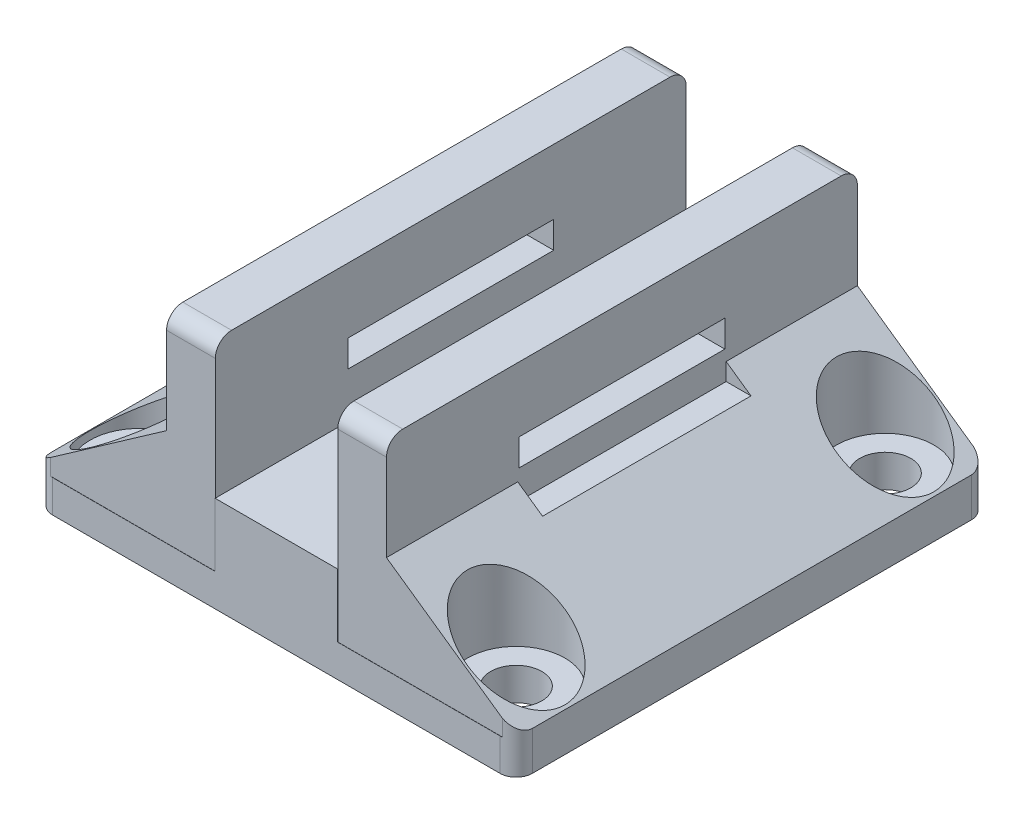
ISO-10303-21;
HEADER;
FILE_DESCRIPTION(('STEP AP214'),'2;1');
FILE_NAME('part.step','',(''),(''),'','','');
FILE_SCHEMA(('AUTOMOTIVE_DESIGN { 1 0 10303 214 1 1 1 1 }'));
ENDSEC;
DATA;
#1=APPLICATION_CONTEXT('core data for automotive mechanical design processes');
#2=APPLICATION_PROTOCOL_DEFINITION('international standard','automotive_design',2000,#1);
#3=PRODUCT_CONTEXT('',#1,'mechanical');
#4=PRODUCT('Part','Part','',(#3));
#5=PRODUCT_RELATED_PRODUCT_CATEGORY('part','',(#4));
#6=PRODUCT_DEFINITION_FORMATION('','',#4);
#7=PRODUCT_DEFINITION_CONTEXT('part definition',#1,'design');
#8=PRODUCT_DEFINITION('design','',#6,#7);
#9=PRODUCT_DEFINITION_SHAPE('','',#8);
#10=(LENGTH_UNIT() NAMED_UNIT(*) SI_UNIT(.MILLI.,.METRE.));
#11=(NAMED_UNIT(*) PLANE_ANGLE_UNIT() SI_UNIT($,.RADIAN.));
#12=(NAMED_UNIT(*) SI_UNIT($,.STERADIAN.) SOLID_ANGLE_UNIT());
#13=UNCERTAINTY_MEASURE_WITH_UNIT(LENGTH_MEASURE(1.E-05),#10,'distance_accuracy_value','');
#14=(GEOMETRIC_REPRESENTATION_CONTEXT(3) GLOBAL_UNCERTAINTY_ASSIGNED_CONTEXT((#13)) GLOBAL_UNIT_ASSIGNED_CONTEXT((#10,
#11,#12)) REPRESENTATION_CONTEXT('',''));
#15=CARTESIAN_POINT('',(0.,0.,0.));
#16=DIRECTION('',(0.,0.,1.));
#17=DIRECTION('',(1.,0.,0.));
#18=AXIS2_PLACEMENT_3D('',#15,#16,#17);
#19=CARTESIAN_POINT('',(-13.3858,10.1600000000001,0.));
#20=DIRECTION('',(-0.573576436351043,0.819152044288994,0.));
#21=DIRECTION('',(0.,0.,-1.));
#22=AXIS2_PLACEMENT_3D('',#19,#20,#21);
#23=PLANE('',#22);
#24=CARTESIAN_POINT('',(-19.5458,5.8467215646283,-14.43));
#25=DIRECTION('',(-0.573576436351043,0.819152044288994,0.));
#26=DIRECTION('',(-0.819152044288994,-0.573576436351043,0.));
#27=AXIS2_PLACEMENT_3D('',#24,#25,#26);
#28=ELLIPSE('',#27,4.65115118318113,3.81);
#29=CARTESIAN_POINT('',(-23.3558,3.17893084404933,-14.43));
#30=VERTEX_POINT('',#29);
#31=EDGE_CURVE('E377',#30,#30,#28,.T.);
#32=ORIENTED_EDGE('',*,*,#31,.F.);
#33=EDGE_LOOP('',(#32));
#34=FACE_BOUND('',#33,.T.);
#35=CARTESIAN_POINT('',(-19.5458,5.8467215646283,14.43));
#36=DIRECTION('',(-0.573576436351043,0.819152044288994,0.));
#37=DIRECTION('',(-0.819152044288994,-0.573576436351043,0.));
#38=AXIS2_PLACEMENT_3D('',#35,#36,#37);
#39=ELLIPSE('',#38,4.65115118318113,3.81);
#40=CARTESIAN_POINT('',(-23.3558,3.17893084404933,14.43));
#41=VERTEX_POINT('',#40);
#42=EDGE_CURVE('E354',#41,#41,#39,.F.);
#43=ORIENTED_EDGE('',*,*,#42,.T.);
#44=EDGE_LOOP('',(#43));
#45=FACE_BOUND('',#44,.T.);
#46=DIRECTION('',(-0.819152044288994,-0.573576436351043,0.));
#47=VECTOR('',#46,1.);
#48=CARTESIAN_POINT('',(-13.3858,10.1600000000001,8.14999999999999));
#49=LINE('',#48,#47);
#50=CARTESIAN_POINT('',(-15.3280813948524,8.799999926,8.14999999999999));
#51=VERTEX_POINT('',#50);
#52=CARTESIAN_POINT('',(-13.3858,10.1600000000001,8.14999999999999));
#53=VERTEX_POINT('',#52);
#54=EDGE_CURVE('E11',#51,#53,#49,.F.);
#55=ORIENTED_EDGE('',*,*,#54,.F.);
#56=DIRECTION('',(0.,0.,1.));
#57=VECTOR('',#56,1.);
#58=CARTESIAN_POINT('',(-15.3280813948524,8.799999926,0.));
#59=LINE('',#58,#57);
#60=CARTESIAN_POINT('',(-15.3280813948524,8.799999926,-8.15000000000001));
#61=VERTEX_POINT('',#60);
#62=EDGE_CURVE('E700',#51,#61,#59,.F.);
#63=ORIENTED_EDGE('',*,*,#62,.T.);
#64=DIRECTION('',(0.819152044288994,0.573576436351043,0.));
#65=VECTOR('',#64,1.);
#66=CARTESIAN_POINT('',(-13.3858,10.1600000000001,-8.15000000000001));
#67=LINE('',#66,#65);
#68=CARTESIAN_POINT('',(-13.3858,10.1600000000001,-8.15000000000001));
#69=VERTEX_POINT('',#68);
#70=EDGE_CURVE('E47',#69,#61,#67,.F.);
#71=ORIENTED_EDGE('',*,*,#70,.F.);
#72=DIRECTION('',(0.,0.,1.));
#73=VECTOR('',#72,1.);
#74=CARTESIAN_POINT('',(-13.3858,10.1600000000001,18.415));
#75=LINE('',#74,#73);
#76=CARTESIAN_POINT('',(-13.3858,10.1600000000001,-18.415));
#77=VERTEX_POINT('',#76);
#78=EDGE_CURVE('E328',#77,#69,#75,.T.);
#79=ORIENTED_EDGE('',*,*,#78,.F.);
#80=DIRECTION('',(-0.819152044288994,-0.573576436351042,0.));
#81=VECTOR('',#80,1.);
#82=CARTESIAN_POINT('',(-13.3858,10.1600000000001,-18.415));
#83=LINE('',#82,#81);
#84=CARTESIAN_POINT('',(-22.4704150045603,3.798884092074,-18.415));
#85=VERTEX_POINT('',#84);
#86=EDGE_CURVE('E665',#85,#77,#83,.F.);
#87=ORIENTED_EDGE('',*,*,#86,.F.);
#88=CARTESIAN_POINT('',(-22.2758,3.93515498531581,-17.16));
#89=DIRECTION('',(-0.573576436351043,0.819152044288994,0.));
#90=DIRECTION('',(-0.819152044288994,-0.573576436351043,0.));
#91=AXIS2_PLACEMENT_3D('',#88,#89,#90);
#92=ELLIPSE('',#91,1.55038372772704,1.27);
#93=CARTESIAN_POINT('',(-23.5458,3.04589141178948,-17.16));
#94=VERTEX_POINT('',#93);
#95=EDGE_CURVE('E663',#94,#85,#92,.F.);
#96=ORIENTED_EDGE('',*,*,#95,.F.);
#97=DIRECTION('',(0.,0.,1.));
#98=VECTOR('',#97,1.);
#99=CARTESIAN_POINT('',(-23.5458,3.04589141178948,-18.43));
#100=LINE('',#99,#98);
#101=CARTESIAN_POINT('',(-23.5458,3.04589141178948,17.16));
#102=VERTEX_POINT('',#101);
#103=EDGE_CURVE('E660',#102,#94,#100,.F.);
#104=ORIENTED_EDGE('',*,*,#103,.F.);
#105=CARTESIAN_POINT('',(-22.2758,3.93515498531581,17.16));
#106=DIRECTION('',(-0.573576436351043,0.819152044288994,0.));
#107=DIRECTION('',(-0.819152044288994,-0.573576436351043,0.));
#108=AXIS2_PLACEMENT_3D('',#105,#106,#107);
#109=ELLIPSE('',#108,1.55038372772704,1.27);
#110=CARTESIAN_POINT('',(-22.4704150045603,3.79888409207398,18.415));
#111=VERTEX_POINT('',#110);
#112=EDGE_CURVE('E657',#111,#102,#109,.F.);
#113=ORIENTED_EDGE('',*,*,#112,.F.);
#114=DIRECTION('',(0.819152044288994,0.573576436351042,0.));
#115=VECTOR('',#114,1.);
#116=CARTESIAN_POINT('',(-13.3858,10.1600000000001,18.415));
#117=LINE('',#116,#115);
#118=CARTESIAN_POINT('',(-13.3858,10.1600000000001,18.415));
#119=VERTEX_POINT('',#118);
#120=EDGE_CURVE('E655',#119,#111,#117,.F.);
#121=ORIENTED_EDGE('',*,*,#120,.F.);
#122=EDGE_CURVE('E649',#53,#119,#75,.T.);
#123=ORIENTED_EDGE('',*,*,#122,.F.);
#124=EDGE_LOOP('',(#55,#63,#71,#79,#87,#96,#104,#113,#121,#123));
#125=FACE_BOUND('',#124,.T.);
#126=ADVANCED_FACE('F38',(#34,#45,#125),#23,.T.);
#127=CARTESIAN_POINT('',(-19.5458,18.23,14.43));
#128=DIRECTION('',(0.,-1.,0.));
#129=DIRECTION('',(0.,0.,-1.));
#130=AXIS2_PLACEMENT_3D('',#127,#128,#129);
#131=CYLINDRICAL_SURFACE('',#130,2.);
#132=CARTESIAN_POINT('',(-19.5458,0.,14.43));
#133=DIRECTION('',(0.,1.,0.));
#134=DIRECTION('',(0.,0.,-1.));
#135=AXIS2_PLACEMENT_3D('',#132,#133,#134);
#136=CIRCLE('',#135,2.);
#137=CARTESIAN_POINT('',(-19.5458,0.,12.43));
#138=VERTEX_POINT('',#137);
#139=EDGE_CURVE('E431',#138,#138,#136,.T.);
#140=ORIENTED_EDGE('',*,*,#139,.F.);
#141=EDGE_LOOP('',(#140));
#142=FACE_BOUND('',#141,.T.);
#143=CARTESIAN_POINT('',(-19.5458,2.54,14.43));
#144=DIRECTION('',(0.,1.,0.));
#145=DIRECTION('',(0.,0.,1.));
#146=AXIS2_PLACEMENT_3D('',#143,#144,#145);
#147=CIRCLE('',#146,2.);
#148=CARTESIAN_POINT('',(-19.5458,2.54,16.43));
#149=VERTEX_POINT('',#148);
#150=EDGE_CURVE('E359',#149,#149,#147,.F.);
#151=ORIENTED_EDGE('',*,*,#150,.F.);
#152=EDGE_LOOP('',(#151));
#153=FACE_BOUND('',#152,.T.);
#154=ADVANCED_FACE('F848',(#142,#153),#131,.F.);
#155=CARTESIAN_POINT('',(9.97000000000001,18.23,14.43));
#156=DIRECTION('',(0.,-1.,0.));
#157=DIRECTION('',(0.,0.,-1.));
#158=AXIS2_PLACEMENT_3D('',#155,#156,#157);
#159=CYLINDRICAL_SURFACE('',#158,2.);
#160=CARTESIAN_POINT('',(9.97000000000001,0.,14.43));
#161=DIRECTION('',(0.,-1.,0.));
#162=DIRECTION('',(0.,0.,-1.));
#163=AXIS2_PLACEMENT_3D('',#160,#161,#162);
#164=CIRCLE('',#163,2.);
#165=CARTESIAN_POINT('',(9.97000000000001,0.,12.43));
#166=VERTEX_POINT('',#165);
#167=EDGE_CURVE('E434',#166,#166,#164,.T.);
#168=ORIENTED_EDGE('',*,*,#167,.T.);
#169=EDGE_LOOP('',(#168));
#170=FACE_BOUND('',#169,.T.);
#171=CARTESIAN_POINT('',(9.97000000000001,2.54,14.43));
#172=DIRECTION('',(0.,1.,0.));
#173=DIRECTION('',(0.,0.,1.));
#174=AXIS2_PLACEMENT_3D('',#171,#172,#173);
#175=CIRCLE('',#174,2.);
#176=CARTESIAN_POINT('',(9.97000000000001,2.54,16.43));
#177=VERTEX_POINT('',#176);
#178=EDGE_CURVE('E362',#177,#177,#175,.T.);
#179=ORIENTED_EDGE('',*,*,#178,.T.);
#180=EDGE_LOOP('',(#179));
#181=FACE_BOUND('',#180,.T.);
#182=ADVANCED_FACE('F853',(#170,#181),#159,.F.);
#183=CARTESIAN_POINT('',(-19.5458,18.23,-14.43));
#184=DIRECTION('',(0.,-1.,0.));
#185=DIRECTION('',(0.,0.,-1.));
#186=AXIS2_PLACEMENT_3D('',#183,#184,#185);
#187=CYLINDRICAL_SURFACE('',#186,2.);
#188=CARTESIAN_POINT('',(-19.5458,0.,-14.43));
#189=DIRECTION('',(0.,-1.,0.));
#190=DIRECTION('',(0.,0.,1.));
#191=AXIS2_PLACEMENT_3D('',#188,#189,#190);
#192=CIRCLE('',#191,2.);
#193=CARTESIAN_POINT('',(-19.5458,0.,-12.43));
#194=VERTEX_POINT('',#193);
#195=EDGE_CURVE('E425',#194,#194,#192,.T.);
#196=ORIENTED_EDGE('',*,*,#195,.T.);
#197=EDGE_LOOP('',(#196));
#198=FACE_BOUND('',#197,.T.);
#199=CARTESIAN_POINT('',(-19.5458,2.54,-14.43));
#200=DIRECTION('',(0.,1.,0.));
#201=DIRECTION('',(0.,0.,1.));
#202=AXIS2_PLACEMENT_3D('',#199,#200,#201);
#203=CIRCLE('',#202,2.);
#204=CARTESIAN_POINT('',(-19.5458,2.54,-12.43));
#205=VERTEX_POINT('',#204);
#206=EDGE_CURVE('E373',#205,#205,#203,.T.);
#207=ORIENTED_EDGE('',*,*,#206,.T.);
#208=EDGE_LOOP('',(#207));
#209=FACE_BOUND('',#208,.T.);
#210=ADVANCED_FACE('F944',(#198,#209),#187,.F.);
#211=CARTESIAN_POINT('',(9.97000000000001,18.23,-14.43));
#212=DIRECTION('',(0.,-1.,0.));
#213=DIRECTION('',(0.,0.,-1.));
#214=AXIS2_PLACEMENT_3D('',#211,#212,#213);
#215=CYLINDRICAL_SURFACE('',#214,2.);
#216=CARTESIAN_POINT('',(9.97000000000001,0.,-14.43));
#217=DIRECTION('',(0.,1.,0.));
#218=DIRECTION('',(0.,0.,1.));
#219=AXIS2_PLACEMENT_3D('',#216,#217,#218);
#220=CIRCLE('',#219,2.);
#221=CARTESIAN_POINT('',(9.97000000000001,0.,-12.43));
#222=VERTEX_POINT('',#221);
#223=EDGE_CURVE('E428',#222,#222,#220,.T.);
#224=ORIENTED_EDGE('',*,*,#223,.F.);
#225=EDGE_LOOP('',(#224));
#226=FACE_BOUND('',#225,.T.);
#227=CARTESIAN_POINT('',(9.97000000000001,2.54,-14.43));
#228=DIRECTION('',(0.,1.,0.));
#229=DIRECTION('',(0.,0.,1.));
#230=AXIS2_PLACEMENT_3D('',#227,#228,#229);
#231=CIRCLE('',#230,2.);
#232=CARTESIAN_POINT('',(9.97000000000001,2.54,-12.43));
#233=VERTEX_POINT('',#232);
#234=EDGE_CURVE('E386',#233,#233,#231,.F.);
#235=ORIENTED_EDGE('',*,*,#234,.F.);
#236=EDGE_LOOP('',(#235));
#237=FACE_BOUND('',#236,.T.);
#238=ADVANCED_FACE('F947',(#226,#237),#215,.F.);
#239=CARTESIAN_POINT('',(0.,2.54,0.));
#240=DIRECTION('',(0.,1.,0.));
#241=DIRECTION('',(0.,0.,1.));
#242=AXIS2_PLACEMENT_3D('',#239,#240,#241);
#243=PLANE('',#242);
#244=CARTESIAN_POINT('',(12.7,2.54,17.16));
#245=DIRECTION('',(0.,1.,0.));
#246=DIRECTION('',(0.,0.,1.));
#247=AXIS2_PLACEMENT_3D('',#244,#245,#246);
#248=CIRCLE('',#247,1.27);
#249=CARTESIAN_POINT('',(12.7,2.54,18.43));
#250=VERTEX_POINT('',#249);
#251=CARTESIAN_POINT('',(12.8946150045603,2.54,18.415));
#252=VERTEX_POINT('',#251);
#253=EDGE_CURVE('E591',#250,#252,#248,.T.);
#254=ORIENTED_EDGE('',*,*,#253,.T.);
#255=DIRECTION('',(1.,0.,0.));
#256=VECTOR('',#255,1.);
#257=CARTESIAN_POINT('',(3.81,2.54,18.415));
#258=LINE('',#257,#256);
#259=CARTESIAN_POINT('',(0.,2.54,18.415));
#260=VERTEX_POINT('',#259);
#261=EDGE_CURVE('E555',#260,#252,#258,.T.);
#262=ORIENTED_EDGE('',*,*,#261,.F.);
#263=DIRECTION('',(0.,0.,-1.));
#264=VECTOR('',#263,1.);
#265=CARTESIAN_POINT('',(0.,2.54,29.2109162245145));
#266=LINE('',#265,#264);
#267=CARTESIAN_POINT('',(0.,2.54,18.43));
#268=VERTEX_POINT('',#267);
#269=EDGE_CURVE('E421',#268,#260,#266,.T.);
#270=ORIENTED_EDGE('',*,*,#269,.F.);
#271=DIRECTION('',(1.,0.,0.));
#272=VECTOR('',#271,1.);
#273=CARTESIAN_POINT('',(-23.5458,2.54,18.43));
#274=LINE('',#273,#272);
#275=EDGE_CURVE('E496',#268,#250,#274,.T.);
#276=ORIENTED_EDGE('',*,*,#275,.T.);
#277=EDGE_LOOP('',(#254,#262,#270,#276));
#278=FACE_BOUND('',#277,.T.);
#279=ADVANCED_FACE('F806',(#278),#243,.T.);
#280=DIRECTION('',(1.,0.,0.));
#281=VECTOR('',#280,1.);
#282=CARTESIAN_POINT('',(0.,2.54,18.415));
#283=LINE('',#282,#281);
#284=CARTESIAN_POINT('',(-22.4704150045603,2.54,18.415));
#285=VERTEX_POINT('',#284);
#286=CARTESIAN_POINT('',(-9.5758,2.54,18.415));
#287=VERTEX_POINT('',#286);
#288=EDGE_CURVE('E478',#285,#287,#283,.T.);
#289=ORIENTED_EDGE('',*,*,#288,.F.);
#290=CARTESIAN_POINT('',(-22.2758,2.54,17.16));
#291=DIRECTION('',(0.,1.,0.));
#292=DIRECTION('',(0.,0.,1.));
#293=AXIS2_PLACEMENT_3D('',#290,#291,#292);
#294=CIRCLE('',#293,1.27);
#295=CARTESIAN_POINT('',(-22.2758,2.54,18.43));
#296=VERTEX_POINT('',#295);
#297=EDGE_CURVE('E589',#285,#296,#294,.T.);
#298=ORIENTED_EDGE('',*,*,#297,.T.);
#299=CARTESIAN_POINT('',(-9.5758,2.54,18.43));
#300=VERTEX_POINT('',#299);
#301=EDGE_CURVE('E498',#296,#300,#274,.T.);
#302=ORIENTED_EDGE('',*,*,#301,.T.);
#303=DIRECTION('',(0.,0.,-1.));
#304=VECTOR('',#303,1.);
#305=CARTESIAN_POINT('',(-9.57579999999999,2.54,29.2109162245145));
#306=LINE('',#305,#304);
#307=EDGE_CURVE('E417',#300,#287,#306,.T.);
#308=ORIENTED_EDGE('',*,*,#307,.T.);
#309=EDGE_LOOP('',(#289,#298,#302,#308));
#310=FACE_BOUND('',#309,.T.);
#311=ADVANCED_FACE('F767',(#310),#243,.T.);
#312=DIRECTION('',(-1.,0.,0.));
#313=VECTOR('',#312,1.);
#314=CARTESIAN_POINT('',(3.81,2.54,-18.415));
#315=LINE('',#314,#313);
#316=CARTESIAN_POINT('',(12.8946150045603,2.54,-18.415));
#317=VERTEX_POINT('',#316);
#318=CARTESIAN_POINT('',(0.,2.54,-18.415));
#319=VERTEX_POINT('',#318);
#320=EDGE_CURVE('E501',#317,#319,#315,.T.);
#321=ORIENTED_EDGE('',*,*,#320,.F.);
#322=CARTESIAN_POINT('',(12.7,2.54,-17.16));
#323=DIRECTION('',(0.,1.,0.));
#324=DIRECTION('',(0.,0.,1.));
#325=AXIS2_PLACEMENT_3D('',#322,#323,#324);
#326=CIRCLE('',#325,1.27);
#327=CARTESIAN_POINT('',(12.7,2.54,-18.43));
#328=VERTEX_POINT('',#327);
#329=EDGE_CURVE('E584',#317,#328,#326,.T.);
#330=ORIENTED_EDGE('',*,*,#329,.T.);
#331=DIRECTION('',(-1.,0.,0.));
#332=VECTOR('',#331,1.);
#333=CARTESIAN_POINT('',(13.97,2.54,-18.43));
#334=LINE('',#333,#332);
#335=CARTESIAN_POINT('',(0.,2.54,-18.43));
#336=VERTEX_POINT('',#335);
#337=EDGE_CURVE('E493',#328,#336,#334,.T.);
#338=ORIENTED_EDGE('',*,*,#337,.T.);
#339=EDGE_CURVE('E408',#319,#336,#266,.T.);
#340=ORIENTED_EDGE('',*,*,#339,.F.);
#341=EDGE_LOOP('',(#321,#330,#338,#340));
#342=FACE_BOUND('',#341,.T.);
#343=ADVANCED_FACE('F785',(#342),#243,.T.);
#344=CARTESIAN_POINT('',(3.81,0.,0.));
#345=DIRECTION('',(1.,0.,0.));
#346=DIRECTION('',(0.,0.,-1.));
#347=AXIS2_PLACEMENT_3D('',#344,#345,#346);
#348=PLANE('',#347);
#349=DIRECTION('',(0.,0.,-1.));
#350=VECTOR('',#349,1.);
#351=CARTESIAN_POINT('',(3.81,10.1600000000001,-18.415));
#352=LINE('',#351,#350);
#353=CARTESIAN_POINT('',(3.81,10.1600000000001,18.415));
#354=VERTEX_POINT('',#353);
#355=CARTESIAN_POINT('',(3.81,10.1600000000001,8.14999999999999));
#356=VERTEX_POINT('',#355);
#357=EDGE_CURVE('E652',#354,#356,#352,.T.);
#358=ORIENTED_EDGE('',*,*,#357,.T.);
#359=DIRECTION('',(0.,-1.,0.));
#360=VECTOR('',#359,1.);
#361=CARTESIAN_POINT('',(3.81,18.229,8.14999999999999));
#362=LINE('',#361,#360);
#363=CARTESIAN_POINT('',(3.81,8.799999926,8.14999999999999));
#364=VERTEX_POINT('',#363);
#365=EDGE_CURVE('E351',#356,#364,#362,.T.);
#366=ORIENTED_EDGE('',*,*,#365,.T.);
#367=DIRECTION('',(0.,0.,-1.));
#368=VECTOR('',#367,1.);
#369=CARTESIAN_POINT('',(3.81,8.799999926,8.14999999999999));
#370=LINE('',#369,#368);
#371=CARTESIAN_POINT('',(3.81,8.799999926,-8.15000000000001));
#372=VERTEX_POINT('',#371);
#373=EDGE_CURVE('E345',#364,#372,#370,.T.);
#374=ORIENTED_EDGE('',*,*,#373,.T.);
#375=DIRECTION('',(0.,-1.,0.));
#376=VECTOR('',#375,1.);
#377=CARTESIAN_POINT('',(3.81,18.229,-8.15000000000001));
#378=LINE('',#377,#376);
#379=CARTESIAN_POINT('',(3.81,10.1600000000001,-8.15000000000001));
#380=VERTEX_POINT('',#379);
#381=EDGE_CURVE('E352',#380,#372,#378,.T.);
#382=ORIENTED_EDGE('',*,*,#381,.F.);
#383=CARTESIAN_POINT('',(3.81,10.1600000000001,-18.415));
#384=VERTEX_POINT('',#383);
#385=EDGE_CURVE('E651',#380,#384,#352,.T.);
#386=ORIENTED_EDGE('',*,*,#385,.T.);
#387=DIRECTION('',(0.,1.,0.));
#388=VECTOR('',#387,1.);
#389=CARTESIAN_POINT('',(3.81,18.229,-18.415));
#390=LINE('',#389,#388);
#391=CARTESIAN_POINT('',(3.81,16.959,-18.415));
#392=VERTEX_POINT('',#391);
#393=EDGE_CURVE('E547',#384,#392,#390,.T.);
#394=ORIENTED_EDGE('',*,*,#393,.T.);
#395=CARTESIAN_POINT('',(3.81,16.959,-17.145));
#396=DIRECTION('',(1.,0.,0.));
#397=DIRECTION('',(0.,0.,-1.));
#398=AXIS2_PLACEMENT_3D('',#395,#396,#397);
#399=CIRCLE('',#398,1.27);
#400=CARTESIAN_POINT('',(3.81,18.229,-17.145));
#401=VERTEX_POINT('',#400);
#402=EDGE_CURVE('E621',#392,#401,#399,.T.);
#403=ORIENTED_EDGE('',*,*,#402,.T.);
#404=DIRECTION('',(0.,0.,1.));
#405=VECTOR('',#404,1.);
#406=CARTESIAN_POINT('',(3.81,18.229,18.415));
#407=LINE('',#406,#405);
#408=CARTESIAN_POINT('',(3.81,18.229,17.145));
#409=VERTEX_POINT('',#408);
#410=EDGE_CURVE('E549',#401,#409,#407,.T.);
#411=ORIENTED_EDGE('',*,*,#410,.T.);
#412=CARTESIAN_POINT('',(3.81,16.959,17.145));
#413=DIRECTION('',(1.,0.,0.));
#414=DIRECTION('',(0.,0.,-1.));
#415=AXIS2_PLACEMENT_3D('',#412,#413,#414);
#416=CIRCLE('',#415,1.27);
#417=CARTESIAN_POINT('',(3.81,16.959,18.415));
#418=VERTEX_POINT('',#417);
#419=EDGE_CURVE('E619',#409,#418,#416,.T.);
#420=ORIENTED_EDGE('',*,*,#419,.T.);
#421=DIRECTION('',(0.,-1.,0.));
#422=VECTOR('',#421,1.);
#423=CARTESIAN_POINT('',(3.81,0.,18.415));
#424=LINE('',#423,#422);
#425=EDGE_CURVE('E552',#418,#354,#424,.T.);
#426=ORIENTED_EDGE('',*,*,#425,.T.);
#427=EDGE_LOOP('',(#358,#366,#374,#382,#386,#394,#403,#411,#420,#426));
#428=FACE_BOUND('',#427,.T.);
#429=DIRECTION('',(0.,-1.,0.));
#430=VECTOR('',#429,1.);
#431=CARTESIAN_POINT('',(3.81,11.049,8.05));
#432=LINE('',#431,#430);
#433=CARTESIAN_POINT('',(3.81,13.149,8.05));
#434=VERTEX_POINT('',#433);
#435=CARTESIAN_POINT('',(3.81,11.049,8.05));
#436=VERTEX_POINT('',#435);
#437=EDGE_CURVE('E518',#434,#436,#432,.T.);
#438=ORIENTED_EDGE('',*,*,#437,.F.);
#439=DIRECTION('',(0.,0.,1.));
#440=VECTOR('',#439,1.);
#441=CARTESIAN_POINT('',(3.81,13.149,8.05));
#442=LINE('',#441,#440);
#443=CARTESIAN_POINT('',(3.81,13.149,-8.05));
#444=VERTEX_POINT('',#443);
#445=EDGE_CURVE('E516',#444,#434,#442,.T.);
#446=ORIENTED_EDGE('',*,*,#445,.F.);
#447=DIRECTION('',(0.,1.,0.));
#448=VECTOR('',#447,1.);
#449=CARTESIAN_POINT('',(3.81,13.149,-8.05));
#450=LINE('',#449,#448);
#451=CARTESIAN_POINT('',(3.81,11.049,-8.05));
#452=VERTEX_POINT('',#451);
#453=EDGE_CURVE('E524',#452,#444,#450,.T.);
#454=ORIENTED_EDGE('',*,*,#453,.F.);
#455=DIRECTION('',(0.,0.,-1.));
#456=VECTOR('',#455,1.);
#457=CARTESIAN_POINT('',(3.81,11.049,8.05));
#458=LINE('',#457,#456);
#459=EDGE_CURVE('E521',#436,#452,#458,.T.);
#460=ORIENTED_EDGE('',*,*,#459,.F.);
#461=EDGE_LOOP('',(#438,#446,#454,#460));
#462=FACE_BOUND('',#461,.T.);
#463=ADVANCED_FACE('F889',(#428,#462),#348,.T.);
#464=CARTESIAN_POINT('',(0.,0.,0.));
#465=DIRECTION('',(1.,0.,0.));
#466=DIRECTION('',(0.,0.,-1.));
#467=AXIS2_PLACEMENT_3D('',#464,#465,#466);
#468=PLANE('',#467);
#469=DIRECTION('',(0.,1.,0.));
#470=VECTOR('',#469,1.);
#471=CARTESIAN_POINT('',(0.,18.229,-18.415));
#472=LINE('',#471,#470);
#473=CARTESIAN_POINT('',(0.,7.493,-18.415));
#474=VERTEX_POINT('',#473);
#475=CARTESIAN_POINT('',(0.,16.959,-18.415));
#476=VERTEX_POINT('',#475);
#477=EDGE_CURVE('E546',#474,#476,#472,.T.);
#478=ORIENTED_EDGE('',*,*,#477,.F.);
#479=DIRECTION('',(0.,0.,-1.));
#480=VECTOR('',#479,1.);
#481=CARTESIAN_POINT('',(0.,7.493,29.2109162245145));
#482=LINE('',#481,#480);
#483=CARTESIAN_POINT('',(0.,7.493,18.415));
#484=VERTEX_POINT('',#483);
#485=EDGE_CURVE('E411',#484,#474,#482,.T.);
#486=ORIENTED_EDGE('',*,*,#485,.F.);
#487=DIRECTION('',(0.,-1.,0.));
#488=VECTOR('',#487,1.);
#489=CARTESIAN_POINT('',(0.,0.,18.415));
#490=LINE('',#489,#488);
#491=CARTESIAN_POINT('',(0.,16.959,18.415));
#492=VERTEX_POINT('',#491);
#493=EDGE_CURVE('E550',#492,#484,#490,.T.);
#494=ORIENTED_EDGE('',*,*,#493,.F.);
#495=CARTESIAN_POINT('',(0.,16.959,17.145));
#496=DIRECTION('',(1.,0.,0.));
#497=DIRECTION('',(0.,0.,-1.));
#498=AXIS2_PLACEMENT_3D('',#495,#496,#497);
#499=CIRCLE('',#498,1.27);
#500=CARTESIAN_POINT('',(0.,18.229,17.145));
#501=VERTEX_POINT('',#500);
#502=EDGE_CURVE('E611',#492,#501,#499,.F.);
#503=ORIENTED_EDGE('',*,*,#502,.T.);
#504=DIRECTION('',(0.,0.,1.));
#505=VECTOR('',#504,1.);
#506=CARTESIAN_POINT('',(0.,18.229,18.415));
#507=LINE('',#506,#505);
#508=CARTESIAN_POINT('',(0.,18.229,-17.145));
#509=VERTEX_POINT('',#508);
#510=EDGE_CURVE('E559',#509,#501,#507,.T.);
#511=ORIENTED_EDGE('',*,*,#510,.F.);
#512=CARTESIAN_POINT('',(0.,16.959,-17.145));
#513=DIRECTION('',(1.,0.,0.));
#514=DIRECTION('',(0.,0.,-1.));
#515=AXIS2_PLACEMENT_3D('',#512,#513,#514);
#516=CIRCLE('',#515,1.27);
#517=EDGE_CURVE('E613',#509,#476,#516,.F.);
#518=ORIENTED_EDGE('',*,*,#517,.T.);
#519=EDGE_LOOP('',(#478,#486,#494,#503,#511,#518));
#520=FACE_BOUND('',#519,.T.);
#521=DIRECTION('',(0.,0.,1.));
#522=VECTOR('',#521,1.);
#523=CARTESIAN_POINT('',(0.,13.149,8.05));
#524=LINE('',#523,#522);
#525=CARTESIAN_POINT('',(0.,13.149,-8.05));
#526=VERTEX_POINT('',#525);
#527=CARTESIAN_POINT('',(0.,13.149,8.05));
#528=VERTEX_POINT('',#527);
#529=EDGE_CURVE('E515',#526,#528,#524,.T.);
#530=ORIENTED_EDGE('',*,*,#529,.T.);
#531=DIRECTION('',(0.,-1.,0.));
#532=VECTOR('',#531,1.);
#533=CARTESIAN_POINT('',(0.,11.049,8.05));
#534=LINE('',#533,#532);
#535=CARTESIAN_POINT('',(0.,11.049,8.05));
#536=VERTEX_POINT('',#535);
#537=EDGE_CURVE('E529',#528,#536,#534,.T.);
#538=ORIENTED_EDGE('',*,*,#537,.T.);
#539=DIRECTION('',(0.,0.,-1.));
#540=VECTOR('',#539,1.);
#541=CARTESIAN_POINT('',(0.,11.049,8.05));
#542=LINE('',#541,#540);
#543=CARTESIAN_POINT('',(0.,11.049,-8.05));
#544=VERTEX_POINT('',#543);
#545=EDGE_CURVE('E532',#536,#544,#542,.T.);
#546=ORIENTED_EDGE('',*,*,#545,.T.);
#547=DIRECTION('',(0.,1.,0.));
#548=VECTOR('',#547,1.);
#549=CARTESIAN_POINT('',(0.,13.149,-8.05));
#550=LINE('',#549,#548);
#551=EDGE_CURVE('E519',#544,#526,#550,.T.);
#552=ORIENTED_EDGE('',*,*,#551,.T.);
#553=EDGE_LOOP('',(#530,#538,#546,#552));
#554=FACE_BOUND('',#553,.T.);
#555=ADVANCED_FACE('F815',(#520,#554),#468,.F.);
#556=CARTESIAN_POINT('',(3.81,18.229,-18.415));
#557=DIRECTION('',(0.,0.,1.));
#558=DIRECTION('',(1.,0.,0.));
#559=AXIS2_PLACEMENT_3D('',#556,#557,#558);
#560=PLANE('',#559);
#561=EDGE_CURVE('E556',#319,#474,#472,.T.);
#562=ORIENTED_EDGE('',*,*,#561,.T.);
#563=ORIENTED_EDGE('',*,*,#477,.T.);
#564=DIRECTION('',(-1.,0.,0.));
#565=VECTOR('',#564,1.);
#566=CARTESIAN_POINT('',(3.81,16.959,-18.415));
#567=LINE('',#566,#565);
#568=EDGE_CURVE('E616',#476,#392,#567,.F.);
#569=ORIENTED_EDGE('',*,*,#568,.T.);
#570=ORIENTED_EDGE('',*,*,#393,.F.);
#571=DIRECTION('',(-0.819152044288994,0.573576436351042,0.));
#572=VECTOR('',#571,1.);
#573=CARTESIAN_POINT('',(0.0188101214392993,12.8146197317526,-18.415));
#574=LINE('',#573,#572);
#575=CARTESIAN_POINT('',(12.8946150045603,3.79888409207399,-18.415));
#576=VERTEX_POINT('',#575);
#577=EDGE_CURVE('E674',#384,#576,#574,.F.);
#578=ORIENTED_EDGE('',*,*,#577,.T.);
#579=DIRECTION('',(0.,-1.,0.));
#580=VECTOR('',#579,1.);
#581=CARTESIAN_POINT('',(12.8946150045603,2.54,-18.415));
#582=LINE('',#581,#580);
#583=EDGE_CURVE('E682',#317,#576,#582,.F.);
#584=ORIENTED_EDGE('',*,*,#583,.F.);
#585=ORIENTED_EDGE('',*,*,#320,.T.);
#586=EDGE_LOOP('',(#562,#563,#569,#570,#578,#584,#585));
#587=FACE_BOUND('',#586,.T.);
#588=ADVANCED_FACE('F836',(#587),#560,.F.);
#589=CARTESIAN_POINT('',(3.81,18.229,18.415));
#590=DIRECTION('',(0.,-1.,0.));
#591=DIRECTION('',(0.,0.,-1.));
#592=AXIS2_PLACEMENT_3D('',#589,#590,#591);
#593=PLANE('',#592);
#594=ORIENTED_EDGE('',*,*,#410,.F.);
#595=DIRECTION('',(-1.,0.,0.));
#596=VECTOR('',#595,1.);
#597=CARTESIAN_POINT('',(3.81,18.229,-17.145));
#598=LINE('',#597,#596);
#599=EDGE_CURVE('E608',#401,#509,#598,.T.);
#600=ORIENTED_EDGE('',*,*,#599,.T.);
#601=ORIENTED_EDGE('',*,*,#510,.T.);
#602=DIRECTION('',(-1.,0.,0.));
#603=VECTOR('',#602,1.);
#604=CARTESIAN_POINT('',(3.81,18.229,17.145));
#605=LINE('',#604,#603);
#606=EDGE_CURVE('E605',#501,#409,#605,.F.);
#607=ORIENTED_EDGE('',*,*,#606,.T.);
#608=EDGE_LOOP('',(#594,#600,#601,#607));
#609=FACE_BOUND('',#608,.T.);
#610=ADVANCED_FACE('F828',(#609),#593,.F.);
#611=CARTESIAN_POINT('',(3.81,0.,18.415));
#612=DIRECTION('',(0.,0.,-1.));
#613=DIRECTION('',(-1.,0.,0.));
#614=AXIS2_PLACEMENT_3D('',#611,#612,#613);
#615=PLANE('',#614);
#616=ORIENTED_EDGE('',*,*,#425,.F.);
#617=DIRECTION('',(-1.,0.,0.));
#618=VECTOR('',#617,1.);
#619=CARTESIAN_POINT('',(3.81,16.959,18.415));
#620=LINE('',#619,#618);
#621=EDGE_CURVE('E623',#418,#492,#620,.T.);
#622=ORIENTED_EDGE('',*,*,#621,.T.);
#623=ORIENTED_EDGE('',*,*,#493,.T.);
#624=DIRECTION('',(0.,-1.,0.));
#625=VECTOR('',#624,1.);
#626=CARTESIAN_POINT('',(0.,0.,18.415));
#627=LINE('',#626,#625);
#628=EDGE_CURVE('E399',#484,#260,#627,.T.);
#629=ORIENTED_EDGE('',*,*,#628,.T.);
#630=ORIENTED_EDGE('',*,*,#261,.T.);
#631=DIRECTION('',(0.,-1.,0.));
#632=VECTOR('',#631,1.);
#633=CARTESIAN_POINT('',(12.8946150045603,3.79888409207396,18.415));
#634=LINE('',#633,#632);
#635=CARTESIAN_POINT('',(12.8946150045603,3.79888409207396,18.415));
#636=VERTEX_POINT('',#635);
#637=EDGE_CURVE('E686',#252,#636,#634,.F.);
#638=ORIENTED_EDGE('',*,*,#637,.T.);
#639=DIRECTION('',(0.819152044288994,-0.573576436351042,0.));
#640=VECTOR('',#639,1.);
#641=CARTESIAN_POINT('',(8.58363851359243,6.81746232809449,18.415));
#642=LINE('',#641,#640);
#643=EDGE_CURVE('E672',#636,#354,#642,.F.);
#644=ORIENTED_EDGE('',*,*,#643,.T.);
#645=EDGE_LOOP('',(#616,#622,#623,#629,#630,#638,#644));
#646=FACE_BOUND('',#645,.T.);
#647=ADVANCED_FACE('F819',(#646),#615,.F.);
#648=CARTESIAN_POINT('',(3.81,13.149,8.05));
#649=DIRECTION('',(0.,-1.,0.));
#650=DIRECTION('',(0.,0.,-1.));
#651=AXIS2_PLACEMENT_3D('',#648,#649,#650);
#652=PLANE('',#651);
#653=ORIENTED_EDGE('',*,*,#529,.F.);
#654=DIRECTION('',(-1.,0.,0.));
#655=VECTOR('',#654,1.);
#656=CARTESIAN_POINT('',(3.81,13.149,-8.05));
#657=LINE('',#656,#655);
#658=EDGE_CURVE('E526',#444,#526,#657,.T.);
#659=ORIENTED_EDGE('',*,*,#658,.F.);
#660=ORIENTED_EDGE('',*,*,#445,.T.);
#661=DIRECTION('',(-1.,0.,0.));
#662=VECTOR('',#661,1.);
#663=CARTESIAN_POINT('',(3.81,13.149,8.05));
#664=LINE('',#663,#662);
#665=EDGE_CURVE('E543',#434,#528,#664,.T.);
#666=ORIENTED_EDGE('',*,*,#665,.T.);
#667=EDGE_LOOP('',(#653,#659,#660,#666));
#668=FACE_BOUND('',#667,.T.);
#669=ADVANCED_FACE('F883',(#668),#652,.T.);
#670=CARTESIAN_POINT('',(3.81,11.049,8.05));
#671=DIRECTION('',(0.,0.,-1.));
#672=DIRECTION('',(-1.,0.,0.));
#673=AXIS2_PLACEMENT_3D('',#670,#671,#672);
#674=PLANE('',#673);
#675=ORIENTED_EDGE('',*,*,#537,.F.);
#676=ORIENTED_EDGE('',*,*,#665,.F.);
#677=ORIENTED_EDGE('',*,*,#437,.T.);
#678=DIRECTION('',(-1.,0.,0.));
#679=VECTOR('',#678,1.);
#680=CARTESIAN_POINT('',(3.81,11.049,8.05));
#681=LINE('',#680,#679);
#682=EDGE_CURVE('E541',#436,#536,#681,.T.);
#683=ORIENTED_EDGE('',*,*,#682,.T.);
#684=EDGE_LOOP('',(#675,#676,#677,#683));
#685=FACE_BOUND('',#684,.T.);
#686=ADVANCED_FACE('F895',(#685),#674,.T.);
#687=CARTESIAN_POINT('',(3.81,11.049,8.05));
#688=DIRECTION('',(0.,1.,0.));
#689=DIRECTION('',(0.,0.,1.));
#690=AXIS2_PLACEMENT_3D('',#687,#688,#689);
#691=PLANE('',#690);
#692=ORIENTED_EDGE('',*,*,#545,.F.);
#693=ORIENTED_EDGE('',*,*,#682,.F.);
#694=ORIENTED_EDGE('',*,*,#459,.T.);
#695=DIRECTION('',(-1.,0.,0.));
#696=VECTOR('',#695,1.);
#697=CARTESIAN_POINT('',(3.81,11.049,-8.05));
#698=LINE('',#697,#696);
#699=EDGE_CURVE('E539',#452,#544,#698,.T.);
#700=ORIENTED_EDGE('',*,*,#699,.T.);
#701=EDGE_LOOP('',(#692,#693,#694,#700));
#702=FACE_BOUND('',#701,.T.);
#703=ADVANCED_FACE('F899',(#702),#691,.T.);
#704=CARTESIAN_POINT('',(3.81,13.149,-8.05));
#705=DIRECTION('',(0.,0.,1.));
#706=DIRECTION('',(1.,0.,0.));
#707=AXIS2_PLACEMENT_3D('',#704,#705,#706);
#708=PLANE('',#707);
#709=ORIENTED_EDGE('',*,*,#551,.F.);
#710=ORIENTED_EDGE('',*,*,#699,.F.);
#711=ORIENTED_EDGE('',*,*,#453,.T.);
#712=ORIENTED_EDGE('',*,*,#658,.T.);
#713=EDGE_LOOP('',(#709,#710,#711,#712));
#714=FACE_BOUND('',#713,.T.);
#715=ADVANCED_FACE('F903',(#714),#708,.T.);
#716=CARTESIAN_POINT('',(-22.2758,2.54,-17.16));
#717=DIRECTION('',(0.,1.,0.));
#718=DIRECTION('',(0.,0.,1.));
#719=AXIS2_PLACEMENT_3D('',#716,#717,#718);
#720=CIRCLE('',#719,1.27);
#721=CARTESIAN_POINT('',(-22.2758,2.54,-18.43));
#722=VERTEX_POINT('',#721);
#723=CARTESIAN_POINT('',(-22.4704150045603,2.54,-18.415));
#724=VERTEX_POINT('',#723);
#725=EDGE_CURVE('E586',#722,#724,#720,.T.);
#726=ORIENTED_EDGE('',*,*,#725,.T.);
#727=DIRECTION('',(-1.,0.,0.));
#728=VECTOR('',#727,1.);
#729=CARTESIAN_POINT('',(0.,2.54,-18.415));
#730=LINE('',#729,#728);
#731=CARTESIAN_POINT('',(-9.5758,2.54,-18.415));
#732=VERTEX_POINT('',#731);
#733=EDGE_CURVE('E490',#732,#724,#730,.T.);
#734=ORIENTED_EDGE('',*,*,#733,.F.);
#735=CARTESIAN_POINT('',(-9.5758,2.54,-18.43));
#736=VERTEX_POINT('',#735);
#737=EDGE_CURVE('E420',#732,#736,#306,.T.);
#738=ORIENTED_EDGE('',*,*,#737,.T.);
#739=EDGE_CURVE('E497',#736,#722,#334,.T.);
#740=ORIENTED_EDGE('',*,*,#739,.T.);
#741=EDGE_LOOP('',(#726,#734,#738,#740));
#742=FACE_BOUND('',#741,.T.);
#743=ADVANCED_FACE('F745',(#742),#243,.T.);
#744=CARTESIAN_POINT('',(13.97,2.54,-18.43));
#745=DIRECTION('',(-1.,0.,0.));
#746=DIRECTION('',(0.,0.,1.));
#747=AXIS2_PLACEMENT_3D('',#744,#745,#746);
#748=PLANE('',#747);
#749=DIRECTION('',(0.,-1.,0.));
#750=VECTOR('',#749,1.);
#751=CARTESIAN_POINT('',(13.97,2.54,-17.16));
#752=LINE('',#751,#750);
#753=CARTESIAN_POINT('',(13.97,0.,-17.16));
#754=VERTEX_POINT('',#753);
#755=CARTESIAN_POINT('',(13.97,3.04589141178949,-17.16));
#756=VERTEX_POINT('',#755);
#757=EDGE_CURVE('E565',#754,#756,#752,.F.);
#758=ORIENTED_EDGE('',*,*,#757,.T.);
#759=DIRECTION('',(0.,0.,-1.));
#760=VECTOR('',#759,1.);
#761=CARTESIAN_POINT('',(13.97,3.04589141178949,-18.43));
#762=LINE('',#761,#760);
#763=CARTESIAN_POINT('',(13.97,3.04589141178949,17.16));
#764=VERTEX_POINT('',#763);
#765=EDGE_CURVE('E667',#756,#764,#762,.F.);
#766=ORIENTED_EDGE('',*,*,#765,.T.);
#767=DIRECTION('',(0.,-1.,0.));
#768=VECTOR('',#767,1.);
#769=CARTESIAN_POINT('',(13.97,2.54,17.16));
#770=LINE('',#769,#768);
#771=CARTESIAN_POINT('',(13.97,0.,17.16));
#772=VERTEX_POINT('',#771);
#773=EDGE_CURVE('E567',#764,#772,#770,.T.);
#774=ORIENTED_EDGE('',*,*,#773,.T.);
#775=DIRECTION('',(0.,0.,-1.));
#776=VECTOR('',#775,1.);
#777=CARTESIAN_POINT('',(13.97,0.,-18.43));
#778=LINE('',#777,#776);
#779=EDGE_CURVE('E492',#772,#754,#778,.T.);
#780=ORIENTED_EDGE('',*,*,#779,.T.);
#781=EDGE_LOOP('',(#758,#766,#774,#780));
#782=FACE_BOUND('',#781,.T.);
#783=ADVANCED_FACE('F794',(#782),#748,.F.);
#784=CARTESIAN_POINT('',(13.97,2.54,-18.43));
#785=DIRECTION('',(0.,0.,1.));
#786=DIRECTION('',(1.,0.,0.));
#787=AXIS2_PLACEMENT_3D('',#784,#785,#786);
#788=PLANE('',#787);
#789=DIRECTION('',(-1.,0.,0.));
#790=VECTOR('',#789,1.);
#791=CARTESIAN_POINT('',(13.97,0.,-18.43));
#792=LINE('',#791,#790);
#793=CARTESIAN_POINT('',(12.7,0.,-18.43));
#794=VERTEX_POINT('',#793);
#795=CARTESIAN_POINT('',(-22.2758,0.,-18.43));
#796=VERTEX_POINT('',#795);
#797=EDGE_CURVE('E504',#794,#796,#792,.T.);
#798=ORIENTED_EDGE('',*,*,#797,.T.);
#799=DIRECTION('',(0.,-1.,0.));
#800=VECTOR('',#799,1.);
#801=CARTESIAN_POINT('',(-22.2758,2.54,-18.43));
#802=LINE('',#801,#800);
#803=EDGE_CURVE('E602',#796,#722,#802,.F.);
#804=ORIENTED_EDGE('',*,*,#803,.T.);
#805=ORIENTED_EDGE('',*,*,#739,.F.);
#806=DIRECTION('',(0.,1.,0.));
#807=VECTOR('',#806,1.);
#808=CARTESIAN_POINT('',(-9.5758,2.54,-18.43));
#809=LINE('',#808,#807);
#810=CARTESIAN_POINT('',(-9.5758,7.493,-18.43));
#811=VERTEX_POINT('',#810);
#812=EDGE_CURVE('E402',#736,#811,#809,.T.);
#813=ORIENTED_EDGE('',*,*,#812,.T.);
#814=DIRECTION('',(1.,0.,0.));
#815=VECTOR('',#814,1.);
#816=CARTESIAN_POINT('',(0.,7.493,-18.43));
#817=LINE('',#816,#815);
#818=CARTESIAN_POINT('',(0.,7.493,-18.43));
#819=VERTEX_POINT('',#818);
#820=EDGE_CURVE('E405',#811,#819,#817,.T.);
#821=ORIENTED_EDGE('',*,*,#820,.T.);
#822=DIRECTION('',(0.,-1.,0.));
#823=VECTOR('',#822,1.);
#824=CARTESIAN_POINT('',(0.,2.54,-18.43));
#825=LINE('',#824,#823);
#826=EDGE_CURVE('E389',#819,#336,#825,.T.);
#827=ORIENTED_EDGE('',*,*,#826,.T.);
#828=ORIENTED_EDGE('',*,*,#337,.F.);
#829=DIRECTION('',(0.,-1.,0.));
#830=VECTOR('',#829,1.);
#831=CARTESIAN_POINT('',(12.7,2.54,-18.43));
#832=LINE('',#831,#830);
#833=EDGE_CURVE('E599',#328,#794,#832,.T.);
#834=ORIENTED_EDGE('',*,*,#833,.T.);
#835=EDGE_LOOP('',(#798,#804,#805,#813,#821,#827,#828,#834));
#836=FACE_BOUND('',#835,.T.);
#837=ADVANCED_FACE('F749',(#836),#788,.F.);
#838=CARTESIAN_POINT('',(-23.5458,2.54,-18.43));
#839=DIRECTION('',(1.,0.,0.));
#840=DIRECTION('',(0.,0.,-1.));
#841=AXIS2_PLACEMENT_3D('',#838,#839,#840);
#842=PLANE('',#841);
#843=DIRECTION('',(0.,0.,1.));
#844=VECTOR('',#843,1.);
#845=CARTESIAN_POINT('',(-23.5458,0.,-18.43));
#846=LINE('',#845,#844);
#847=CARTESIAN_POINT('',(-23.5458,0.,-17.16));
#848=VERTEX_POINT('',#847);
#849=CARTESIAN_POINT('',(-23.5458,0.,17.16));
#850=VERTEX_POINT('',#849);
#851=EDGE_CURVE('E507',#848,#850,#846,.T.);
#852=ORIENTED_EDGE('',*,*,#851,.T.);
#853=DIRECTION('',(0.,-1.,0.));
#854=VECTOR('',#853,1.);
#855=CARTESIAN_POINT('',(-23.5458,2.54,17.16));
#856=LINE('',#855,#854);
#857=EDGE_CURVE('E597',#850,#102,#856,.F.);
#858=ORIENTED_EDGE('',*,*,#857,.T.);
#859=ORIENTED_EDGE('',*,*,#103,.T.);
#860=DIRECTION('',(0.,-1.,0.));
#861=VECTOR('',#860,1.);
#862=CARTESIAN_POINT('',(-23.5458,2.54,-17.16));
#863=LINE('',#862,#861);
#864=EDGE_CURVE('E594',#94,#848,#863,.T.);
#865=ORIENTED_EDGE('',*,*,#864,.T.);
#866=EDGE_LOOP('',(#852,#858,#859,#865));
#867=FACE_BOUND('',#866,.T.);
#868=ADVANCED_FACE('F760',(#867),#842,.F.);
#869=CARTESIAN_POINT('',(-23.5458,2.54,18.43));
#870=DIRECTION('',(0.,0.,-1.));
#871=DIRECTION('',(-1.,0.,0.));
#872=AXIS2_PLACEMENT_3D('',#869,#870,#871);
#873=PLANE('',#872);
#874=DIRECTION('',(1.,0.,0.));
#875=VECTOR('',#874,1.);
#876=CARTESIAN_POINT('',(-23.5458,0.,18.43));
#877=LINE('',#876,#875);
#878=CARTESIAN_POINT('',(-22.2758,0.,18.43));
#879=VERTEX_POINT('',#878);
#880=CARTESIAN_POINT('',(12.7,0.,18.43));
#881=VERTEX_POINT('',#880);
#882=EDGE_CURVE('E510',#879,#881,#877,.T.);
#883=ORIENTED_EDGE('',*,*,#882,.T.);
#884=DIRECTION('',(0.,-1.,0.));
#885=VECTOR('',#884,1.);
#886=CARTESIAN_POINT('',(12.7,2.54,18.43));
#887=LINE('',#886,#885);
#888=EDGE_CURVE('E581',#881,#250,#887,.F.);
#889=ORIENTED_EDGE('',*,*,#888,.T.);
#890=ORIENTED_EDGE('',*,*,#275,.F.);
#891=DIRECTION('',(0.,1.,0.));
#892=VECTOR('',#891,1.);
#893=CARTESIAN_POINT('',(0.,2.54,18.43));
#894=LINE('',#893,#892);
#895=CARTESIAN_POINT('',(0.,7.493,18.43));
#896=VERTEX_POINT('',#895);
#897=EDGE_CURVE('E397',#268,#896,#894,.T.);
#898=ORIENTED_EDGE('',*,*,#897,.T.);
#899=DIRECTION('',(-1.,0.,0.));
#900=VECTOR('',#899,1.);
#901=CARTESIAN_POINT('',(0.,7.493,18.43));
#902=LINE('',#901,#900);
#903=CARTESIAN_POINT('',(-9.5758,7.493,18.43));
#904=VERTEX_POINT('',#903);
#905=EDGE_CURVE('E394',#896,#904,#902,.T.);
#906=ORIENTED_EDGE('',*,*,#905,.T.);
#907=DIRECTION('',(0.,-1.,0.));
#908=VECTOR('',#907,1.);
#909=CARTESIAN_POINT('',(-9.5758,2.54,18.43));
#910=LINE('',#909,#908);
#911=EDGE_CURVE('E392',#904,#300,#910,.T.);
#912=ORIENTED_EDGE('',*,*,#911,.T.);
#913=ORIENTED_EDGE('',*,*,#301,.F.);
#914=DIRECTION('',(0.,-1.,0.));
#915=VECTOR('',#914,1.);
#916=CARTESIAN_POINT('',(-22.2758,2.54,18.43));
#917=LINE('',#916,#915);
#918=EDGE_CURVE('E578',#296,#879,#917,.T.);
#919=ORIENTED_EDGE('',*,*,#918,.T.);
#920=EDGE_LOOP('',(#883,#889,#890,#898,#906,#912,#913,#919));
#921=FACE_BOUND('',#920,.T.);
#922=ADVANCED_FACE('F799',(#921),#873,.F.);
#923=CARTESIAN_POINT('',(3.81,0.,18.415));
#924=DIRECTION('',(0.,1.,0.));
#925=DIRECTION('',(0.,0.,1.));
#926=AXIS2_PLACEMENT_3D('',#923,#924,#925);
#927=PLANE('',#926);
#928=ORIENTED_EDGE('',*,*,#195,.F.);
#929=EDGE_LOOP('',(#928));
#930=FACE_BOUND('',#929,.T.);
#931=ORIENTED_EDGE('',*,*,#223,.T.);
#932=EDGE_LOOP('',(#931));
#933=FACE_BOUND('',#932,.T.);
#934=ORIENTED_EDGE('',*,*,#139,.T.);
#935=EDGE_LOOP('',(#934));
#936=FACE_BOUND('',#935,.T.);
#937=ORIENTED_EDGE('',*,*,#167,.F.);
#938=EDGE_LOOP('',(#937));
#939=FACE_BOUND('',#938,.T.);
#940=ORIENTED_EDGE('',*,*,#779,.F.);
#941=CARTESIAN_POINT('',(12.7,0.,17.16));
#942=DIRECTION('',(0.,1.,0.));
#943=DIRECTION('',(0.,0.,1.));
#944=AXIS2_PLACEMENT_3D('',#941,#942,#943);
#945=CIRCLE('',#944,1.27);
#946=EDGE_CURVE('E576',#772,#881,#945,.F.);
#947=ORIENTED_EDGE('',*,*,#946,.T.);
#948=ORIENTED_EDGE('',*,*,#882,.F.);
#949=CARTESIAN_POINT('',(-22.2758,0.,17.16));
#950=DIRECTION('',(0.,1.,0.));
#951=DIRECTION('',(0.,0.,1.));
#952=AXIS2_PLACEMENT_3D('',#949,#950,#951);
#953=CIRCLE('',#952,1.27);
#954=EDGE_CURVE('E574',#879,#850,#953,.F.);
#955=ORIENTED_EDGE('',*,*,#954,.T.);
#956=ORIENTED_EDGE('',*,*,#851,.F.);
#957=CARTESIAN_POINT('',(-22.2758,0.,-17.16));
#958=DIRECTION('',(0.,1.,0.));
#959=DIRECTION('',(0.,0.,1.));
#960=AXIS2_PLACEMENT_3D('',#957,#958,#959);
#961=CIRCLE('',#960,1.27);
#962=EDGE_CURVE('E572',#848,#796,#961,.F.);
#963=ORIENTED_EDGE('',*,*,#962,.T.);
#964=ORIENTED_EDGE('',*,*,#797,.F.);
#965=CARTESIAN_POINT('',(12.7,0.,-17.16));
#966=DIRECTION('',(0.,1.,0.));
#967=DIRECTION('',(0.,0.,1.));
#968=AXIS2_PLACEMENT_3D('',#965,#966,#967);
#969=CIRCLE('',#968,1.27);
#970=EDGE_CURVE('E570',#794,#754,#969,.F.);
#971=ORIENTED_EDGE('',*,*,#970,.T.);
#972=EDGE_LOOP('',(#940,#947,#948,#955,#956,#963,#964,#971));
#973=FACE_BOUND('',#972,.T.);
#974=ADVANCED_FACE('F755',(#930,#933,#936,#939,#973),#927,.F.);
#975=CARTESIAN_POINT('',(-13.3858,18.229,-18.415));
#976=DIRECTION('',(0.,0.,-1.));
#977=DIRECTION('',(-1.,0.,0.));
#978=AXIS2_PLACEMENT_3D('',#975,#976,#977);
#979=PLANE('',#978);
#980=ORIENTED_EDGE('',*,*,#733,.T.);
#981=DIRECTION('',(0.,-1.,0.));
#982=VECTOR('',#981,1.);
#983=CARTESIAN_POINT('',(-22.4704150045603,3.798884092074,-18.415));
#984=LINE('',#983,#982);
#985=EDGE_CURVE('E683',#724,#85,#984,.F.);
#986=ORIENTED_EDGE('',*,*,#985,.T.);
#987=ORIENTED_EDGE('',*,*,#86,.T.);
#988=DIRECTION('',(0.,1.,0.));
#989=VECTOR('',#988,1.);
#990=CARTESIAN_POINT('',(-13.3858,18.229,-18.415));
#991=LINE('',#990,#989);
#992=CARTESIAN_POINT('',(-13.3858,16.959,-18.415));
#993=VERTEX_POINT('',#992);
#994=EDGE_CURVE('E470',#77,#993,#991,.T.);
#995=ORIENTED_EDGE('',*,*,#994,.T.);
#996=DIRECTION('',(1.,0.,0.));
#997=VECTOR('',#996,1.);
#998=CARTESIAN_POINT('',(-13.3858,16.959,-18.415));
#999=LINE('',#998,#997);
#1000=CARTESIAN_POINT('',(-9.5758,16.959,-18.415));
#1001=VERTEX_POINT('',#1000);
#1002=EDGE_CURVE('E643',#993,#1001,#999,.T.);
#1003=ORIENTED_EDGE('',*,*,#1002,.T.);
#1004=DIRECTION('',(0.,1.,0.));
#1005=VECTOR('',#1004,1.);
#1006=CARTESIAN_POINT('',(-9.5758,18.229,-18.415));
#1007=LINE('',#1006,#1005);
#1008=CARTESIAN_POINT('',(-9.5758,7.493,-18.415));
#1009=VERTEX_POINT('',#1008);
#1010=EDGE_CURVE('E469',#1009,#1001,#1007,.T.);
#1011=ORIENTED_EDGE('',*,*,#1010,.F.);
#1012=EDGE_CURVE('E479',#732,#1009,#1007,.T.);
#1013=ORIENTED_EDGE('',*,*,#1012,.F.);
#1014=EDGE_LOOP('',(#980,#986,#987,#995,#1003,#1011,#1013));
#1015=FACE_BOUND('',#1014,.T.);
#1016=ADVANCED_FACE('F734',(#1015),#979,.T.);
#1017=CARTESIAN_POINT('',(-13.3858,0.,18.415));
#1018=DIRECTION('',(0.,0.,1.));
#1019=DIRECTION('',(1.,0.,0.));
#1020=AXIS2_PLACEMENT_3D('',#1017,#1018,#1019);
#1021=PLANE('',#1020);
#1022=DIRECTION('',(0.,-1.,0.));
#1023=VECTOR('',#1022,1.);
#1024=CARTESIAN_POINT('',(-9.5758,0.,18.415));
#1025=LINE('',#1024,#1023);
#1026=CARTESIAN_POINT('',(-9.5758,16.959,18.415));
#1027=VERTEX_POINT('',#1026);
#1028=CARTESIAN_POINT('',(-9.5758,7.493,18.415));
#1029=VERTEX_POINT('',#1028);
#1030=EDGE_CURVE('E483',#1027,#1029,#1025,.T.);
#1031=ORIENTED_EDGE('',*,*,#1030,.F.);
#1032=DIRECTION('',(1.,0.,0.));
#1033=VECTOR('',#1032,1.);
#1034=CARTESIAN_POINT('',(-13.3858,16.959,18.415));
#1035=LINE('',#1034,#1033);
#1036=CARTESIAN_POINT('',(-13.3858,16.959,18.415));
#1037=VERTEX_POINT('',#1036);
#1038=EDGE_CURVE('E635',#1027,#1037,#1035,.F.);
#1039=ORIENTED_EDGE('',*,*,#1038,.T.);
#1040=DIRECTION('',(0.,-1.,0.));
#1041=VECTOR('',#1040,1.);
#1042=CARTESIAN_POINT('',(-13.3858,0.,18.415));
#1043=LINE('',#1042,#1041);
#1044=EDGE_CURVE('E472',#1037,#119,#1043,.T.);
#1045=ORIENTED_EDGE('',*,*,#1044,.T.);
#1046=ORIENTED_EDGE('',*,*,#120,.T.);
#1047=DIRECTION('',(0.,-1.,0.));
#1048=VECTOR('',#1047,1.);
#1049=CARTESIAN_POINT('',(-22.4704150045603,2.54,18.415));
#1050=LINE('',#1049,#1048);
#1051=EDGE_CURVE('E679',#285,#111,#1050,.F.);
#1052=ORIENTED_EDGE('',*,*,#1051,.F.);
#1053=ORIENTED_EDGE('',*,*,#288,.T.);
#1054=EDGE_CURVE('E482',#1029,#287,#1025,.T.);
#1055=ORIENTED_EDGE('',*,*,#1054,.F.);
#1056=EDGE_LOOP('',(#1031,#1039,#1045,#1046,#1052,#1053,#1055));
#1057=FACE_BOUND('',#1056,.T.);
#1058=ADVANCED_FACE('F713',(#1057),#1021,.T.);
#1059=CARTESIAN_POINT('',(-13.3858,18.229,18.415));
#1060=DIRECTION('',(0.,1.,0.));
#1061=DIRECTION('',(0.,0.,1.));
#1062=AXIS2_PLACEMENT_3D('',#1059,#1060,#1061);
#1063=PLANE('',#1062);
#1064=DIRECTION('',(0.,0.,1.));
#1065=VECTOR('',#1064,1.);
#1066=CARTESIAN_POINT('',(-13.3858,18.229,18.415));
#1067=LINE('',#1066,#1065);
#1068=CARTESIAN_POINT('',(-13.3858,18.229,-17.145));
#1069=VERTEX_POINT('',#1068);
#1070=CARTESIAN_POINT('',(-13.3858,18.229,17.145));
#1071=VERTEX_POINT('',#1070);
#1072=EDGE_CURVE('E476',#1069,#1071,#1067,.T.);
#1073=ORIENTED_EDGE('',*,*,#1072,.T.);
#1074=DIRECTION('',(1.,0.,0.));
#1075=VECTOR('',#1074,1.);
#1076=CARTESIAN_POINT('',(-13.3858,18.229,17.145));
#1077=LINE('',#1076,#1075);
#1078=CARTESIAN_POINT('',(-9.5758,18.229,17.145));
#1079=VERTEX_POINT('',#1078);
#1080=EDGE_CURVE('E628',#1071,#1079,#1077,.T.);
#1081=ORIENTED_EDGE('',*,*,#1080,.T.);
#1082=DIRECTION('',(0.,0.,1.));
#1083=VECTOR('',#1082,1.);
#1084=CARTESIAN_POINT('',(-9.5758,18.229,18.415));
#1085=LINE('',#1084,#1083);
#1086=CARTESIAN_POINT('',(-9.5758,18.229,-17.145));
#1087=VERTEX_POINT('',#1086);
#1088=EDGE_CURVE('E473',#1087,#1079,#1085,.T.);
#1089=ORIENTED_EDGE('',*,*,#1088,.F.);
#1090=DIRECTION('',(1.,0.,0.));
#1091=VECTOR('',#1090,1.);
#1092=CARTESIAN_POINT('',(-13.3858,18.229,-17.145));
#1093=LINE('',#1092,#1091);
#1094=EDGE_CURVE('E626',#1087,#1069,#1093,.F.);
#1095=ORIENTED_EDGE('',*,*,#1094,.T.);
#1096=EDGE_LOOP('',(#1073,#1081,#1089,#1095));
#1097=FACE_BOUND('',#1096,.T.);
#1098=ADVANCED_FACE('F722',(#1097),#1063,.T.);
#1099=CARTESIAN_POINT('',(-13.3858,0.,0.));
#1100=DIRECTION('',(-1.,0.,0.));
#1101=DIRECTION('',(0.,0.,-1.));
#1102=AXIS2_PLACEMENT_3D('',#1099,#1100,#1101);
#1103=PLANE('',#1102);
#1104=DIRECTION('',(0.,-1.,0.));
#1105=VECTOR('',#1104,1.);
#1106=CARTESIAN_POINT('',(-13.3858,18.229,8.14999999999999));
#1107=LINE('',#1106,#1105);
#1108=CARTESIAN_POINT('',(-13.3858,8.799999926,8.14999999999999));
#1109=VERTEX_POINT('',#1108);
#1110=EDGE_CURVE('E331',#53,#1109,#1107,.T.);
#1111=ORIENTED_EDGE('',*,*,#1110,.F.);
#1112=ORIENTED_EDGE('',*,*,#122,.T.);
#1113=ORIENTED_EDGE('',*,*,#1044,.F.);
#1114=CARTESIAN_POINT('',(-13.3858,16.959,17.145));
#1115=DIRECTION('',(-1.,0.,0.));
#1116=DIRECTION('',(0.,0.,1.));
#1117=AXIS2_PLACEMENT_3D('',#1114,#1115,#1116);
#1118=CIRCLE('',#1117,1.27);
#1119=EDGE_CURVE('E640',#1037,#1071,#1118,.T.);
#1120=ORIENTED_EDGE('',*,*,#1119,.T.);
#1121=ORIENTED_EDGE('',*,*,#1072,.F.);
#1122=CARTESIAN_POINT('',(-13.3858,16.959,-17.145));
#1123=DIRECTION('',(-1.,0.,0.));
#1124=DIRECTION('',(0.,0.,1.));
#1125=AXIS2_PLACEMENT_3D('',#1122,#1123,#1124);
#1126=CIRCLE('',#1125,1.27);
#1127=EDGE_CURVE('E637',#1069,#993,#1126,.T.);
#1128=ORIENTED_EDGE('',*,*,#1127,.T.);
#1129=ORIENTED_EDGE('',*,*,#994,.F.);
#1130=ORIENTED_EDGE('',*,*,#78,.T.);
#1131=DIRECTION('',(0.,-1.,0.));
#1132=VECTOR('',#1131,1.);
#1133=CARTESIAN_POINT('',(-13.3858,18.229,-8.15000000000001));
#1134=LINE('',#1133,#1132);
#1135=CARTESIAN_POINT('',(-13.3858,8.799999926,-8.15000000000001));
#1136=VERTEX_POINT('',#1135);
#1137=EDGE_CURVE('E321',#69,#1136,#1134,.T.);
#1138=ORIENTED_EDGE('',*,*,#1137,.T.);
#1139=DIRECTION('',(0.,0.,-1.));
#1140=VECTOR('',#1139,1.);
#1141=CARTESIAN_POINT('',(-13.3858,8.799999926,8.14999999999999));
#1142=LINE('',#1141,#1140);
#1143=EDGE_CURVE('E325',#1109,#1136,#1142,.T.);
#1144=ORIENTED_EDGE('',*,*,#1143,.F.);
#1145=EDGE_LOOP('',(#1111,#1112,#1113,#1120,#1121,#1128,#1129,#1130,#1138,#1144));
#1146=FACE_BOUND('',#1145,.T.);
#1147=DIRECTION('',(0.,0.,1.));
#1148=VECTOR('',#1147,1.);
#1149=CARTESIAN_POINT('',(-13.3858,13.149,8.05));
#1150=LINE('',#1149,#1148);
#1151=CARTESIAN_POINT('',(-13.3858,13.149,-8.05));
#1152=VERTEX_POINT('',#1151);
#1153=CARTESIAN_POINT('',(-13.3858,13.149,8.05));
#1154=VERTEX_POINT('',#1153);
#1155=EDGE_CURVE('E438',#1152,#1154,#1150,.T.);
#1156=ORIENTED_EDGE('',*,*,#1155,.T.);
#1157=DIRECTION('',(0.,-1.,0.));
#1158=VECTOR('',#1157,1.);
#1159=CARTESIAN_POINT('',(-13.3858,11.049,8.05));
#1160=LINE('',#1159,#1158);
#1161=CARTESIAN_POINT('',(-13.3858,11.049,8.05));
#1162=VERTEX_POINT('',#1161);
#1163=EDGE_CURVE('E448',#1154,#1162,#1160,.T.);
#1164=ORIENTED_EDGE('',*,*,#1163,.T.);
#1165=DIRECTION('',(0.,0.,-1.));
#1166=VECTOR('',#1165,1.);
#1167=CARTESIAN_POINT('',(-13.3858,11.049,8.05));
#1168=LINE('',#1167,#1166);
#1169=CARTESIAN_POINT('',(-13.3858,11.049,-8.05));
#1170=VERTEX_POINT('',#1169);
#1171=EDGE_CURVE('E445',#1162,#1170,#1168,.T.);
#1172=ORIENTED_EDGE('',*,*,#1171,.T.);
#1173=DIRECTION('',(0.,1.,0.));
#1174=VECTOR('',#1173,1.);
#1175=CARTESIAN_POINT('',(-13.3858,13.149,-8.05));
#1176=LINE('',#1175,#1174);
#1177=EDGE_CURVE('E441',#1170,#1152,#1176,.T.);
#1178=ORIENTED_EDGE('',*,*,#1177,.T.);
#1179=EDGE_LOOP('',(#1156,#1164,#1172,#1178));
#1180=FACE_BOUND('',#1179,.T.);
#1181=ADVANCED_FACE('F323',(#1146,#1180),#1103,.T.);
#1182=CARTESIAN_POINT('',(-9.5758,0.,0.));
#1183=DIRECTION('',(-1.,0.,0.));
#1184=DIRECTION('',(0.,0.,-1.));
#1185=AXIS2_PLACEMENT_3D('',#1182,#1183,#1184);
#1186=PLANE('',#1185);
#1187=ORIENTED_EDGE('',*,*,#1030,.T.);
#1188=DIRECTION('',(0.,0.,-1.));
#1189=VECTOR('',#1188,1.);
#1190=CARTESIAN_POINT('',(-9.5758,7.493,0.));
#1191=LINE('',#1190,#1189);
#1192=EDGE_CURVE('E646',#1029,#1009,#1191,.T.);
#1193=ORIENTED_EDGE('',*,*,#1192,.T.);
#1194=ORIENTED_EDGE('',*,*,#1010,.T.);
#1195=CARTESIAN_POINT('',(-9.5758,16.959,-17.145));
#1196=DIRECTION('',(-1.,0.,0.));
#1197=DIRECTION('',(0.,0.,1.));
#1198=AXIS2_PLACEMENT_3D('',#1195,#1196,#1197);
#1199=CIRCLE('',#1198,1.27);
#1200=EDGE_CURVE('E631',#1001,#1087,#1199,.F.);
#1201=ORIENTED_EDGE('',*,*,#1200,.T.);
#1202=ORIENTED_EDGE('',*,*,#1088,.T.);
#1203=CARTESIAN_POINT('',(-9.5758,16.959,17.145));
#1204=DIRECTION('',(-1.,0.,0.));
#1205=DIRECTION('',(0.,0.,1.));
#1206=AXIS2_PLACEMENT_3D('',#1203,#1204,#1205);
#1207=CIRCLE('',#1206,1.27);
#1208=EDGE_CURVE('E633',#1079,#1027,#1207,.F.);
#1209=ORIENTED_EDGE('',*,*,#1208,.T.);
#1210=EDGE_LOOP('',(#1187,#1193,#1194,#1201,#1202,#1209));
#1211=FACE_BOUND('',#1210,.T.);
#1212=DIRECTION('',(0.,-1.,0.));
#1213=VECTOR('',#1212,1.);
#1214=CARTESIAN_POINT('',(-9.5758,11.049,8.05));
#1215=LINE('',#1214,#1213);
#1216=CARTESIAN_POINT('',(-9.5758,13.149,8.05));
#1217=VERTEX_POINT('',#1216);
#1218=CARTESIAN_POINT('',(-9.5758,11.049,8.05));
#1219=VERTEX_POINT('',#1218);
#1220=EDGE_CURVE('E442',#1217,#1219,#1215,.T.);
#1221=ORIENTED_EDGE('',*,*,#1220,.F.);
#1222=DIRECTION('',(0.,0.,1.));
#1223=VECTOR('',#1222,1.);
#1224=CARTESIAN_POINT('',(-9.5758,13.149,8.05));
#1225=LINE('',#1224,#1223);
#1226=CARTESIAN_POINT('',(-9.5758,13.149,-8.05));
#1227=VERTEX_POINT('',#1226);
#1228=EDGE_CURVE('E437',#1227,#1217,#1225,.T.);
#1229=ORIENTED_EDGE('',*,*,#1228,.F.);
#1230=DIRECTION('',(0.,1.,0.));
#1231=VECTOR('',#1230,1.);
#1232=CARTESIAN_POINT('',(-9.5758,13.149,-8.05));
#1233=LINE('',#1232,#1231);
#1234=CARTESIAN_POINT('',(-9.5758,11.049,-8.05));
#1235=VERTEX_POINT('',#1234);
#1236=EDGE_CURVE('E453',#1235,#1227,#1233,.T.);
#1237=ORIENTED_EDGE('',*,*,#1236,.F.);
#1238=DIRECTION('',(0.,0.,-1.));
#1239=VECTOR('',#1238,1.);
#1240=CARTESIAN_POINT('',(-9.5758,11.049,8.05));
#1241=LINE('',#1240,#1239);
#1242=EDGE_CURVE('E456',#1219,#1235,#1241,.T.);
#1243=ORIENTED_EDGE('',*,*,#1242,.F.);
#1244=EDGE_LOOP('',(#1221,#1229,#1237,#1243));
#1245=FACE_BOUND('',#1244,.T.);
#1246=ADVANCED_FACE('F725',(#1211,#1245),#1186,.F.);
#1247=CARTESIAN_POINT('',(-13.3858,13.149,8.05));
#1248=DIRECTION('',(0.,1.,0.));
#1249=DIRECTION('',(0.,0.,1.));
#1250=AXIS2_PLACEMENT_3D('',#1247,#1248,#1249);
#1251=PLANE('',#1250);
#1252=ORIENTED_EDGE('',*,*,#1228,.T.);
#1253=DIRECTION('',(1.,0.,0.));
#1254=VECTOR('',#1253,1.);
#1255=CARTESIAN_POINT('',(-13.3858,13.149,8.05));
#1256=LINE('',#1255,#1254);
#1257=EDGE_CURVE('E451',#1154,#1217,#1256,.T.);
#1258=ORIENTED_EDGE('',*,*,#1257,.F.);
#1259=ORIENTED_EDGE('',*,*,#1155,.F.);
#1260=DIRECTION('',(1.,0.,0.));
#1261=VECTOR('',#1260,1.);
#1262=CARTESIAN_POINT('',(-13.3858,13.149,-8.05));
#1263=LINE('',#1262,#1261);
#1264=EDGE_CURVE('E467',#1152,#1227,#1263,.T.);
#1265=ORIENTED_EDGE('',*,*,#1264,.T.);
#1266=EDGE_LOOP('',(#1252,#1258,#1259,#1265));
#1267=FACE_BOUND('',#1266,.T.);
#1268=ADVANCED_FACE('F926',(#1267),#1251,.F.);
#1269=CARTESIAN_POINT('',(-13.3858,13.149,-8.05));
#1270=DIRECTION('',(0.,0.,-1.));
#1271=DIRECTION('',(-1.,0.,0.));
#1272=AXIS2_PLACEMENT_3D('',#1269,#1270,#1271);
#1273=PLANE('',#1272);
#1274=ORIENTED_EDGE('',*,*,#1236,.T.);
#1275=ORIENTED_EDGE('',*,*,#1264,.F.);
#1276=ORIENTED_EDGE('',*,*,#1177,.F.);
#1277=DIRECTION('',(1.,0.,0.));
#1278=VECTOR('',#1277,1.);
#1279=CARTESIAN_POINT('',(-13.3858,11.049,-8.05));
#1280=LINE('',#1279,#1278);
#1281=EDGE_CURVE('E465',#1170,#1235,#1280,.T.);
#1282=ORIENTED_EDGE('',*,*,#1281,.T.);
#1283=EDGE_LOOP('',(#1274,#1275,#1276,#1282));
#1284=FACE_BOUND('',#1283,.T.);
#1285=ADVANCED_FACE('F931',(#1284),#1273,.F.);
#1286=CARTESIAN_POINT('',(-13.3858,11.049,8.05));
#1287=DIRECTION('',(0.,-1.,0.));
#1288=DIRECTION('',(0.,0.,-1.));
#1289=AXIS2_PLACEMENT_3D('',#1286,#1287,#1288);
#1290=PLANE('',#1289);
#1291=ORIENTED_EDGE('',*,*,#1242,.T.);
#1292=ORIENTED_EDGE('',*,*,#1281,.F.);
#1293=ORIENTED_EDGE('',*,*,#1171,.F.);
#1294=DIRECTION('',(1.,0.,0.));
#1295=VECTOR('',#1294,1.);
#1296=CARTESIAN_POINT('',(-13.3858,11.049,8.05));
#1297=LINE('',#1296,#1295);
#1298=EDGE_CURVE('E463',#1162,#1219,#1297,.T.);
#1299=ORIENTED_EDGE('',*,*,#1298,.T.);
#1300=EDGE_LOOP('',(#1291,#1292,#1293,#1299));
#1301=FACE_BOUND('',#1300,.T.);
#1302=ADVANCED_FACE('F935',(#1301),#1290,.F.);
#1303=CARTESIAN_POINT('',(-13.3858,11.049,8.05));
#1304=DIRECTION('',(0.,0.,1.));
#1305=DIRECTION('',(1.,0.,0.));
#1306=AXIS2_PLACEMENT_3D('',#1303,#1304,#1305);
#1307=PLANE('',#1306);
#1308=ORIENTED_EDGE('',*,*,#1220,.T.);
#1309=ORIENTED_EDGE('',*,*,#1298,.F.);
#1310=ORIENTED_EDGE('',*,*,#1163,.F.);
#1311=ORIENTED_EDGE('',*,*,#1257,.T.);
#1312=EDGE_LOOP('',(#1308,#1309,#1310,#1311));
#1313=FACE_BOUND('',#1312,.T.);
#1314=ADVANCED_FACE('F876',(#1313),#1307,.F.);
#1315=CARTESIAN_POINT('',(12.7,2.54,17.16));
#1316=DIRECTION('',(0.,-1.,0.));
#1317=DIRECTION('',(0.,0.,-1.));
#1318=AXIS2_PLACEMENT_3D('',#1315,#1316,#1317);
#1319=CYLINDRICAL_SURFACE('',#1318,1.27);
#1320=ORIENTED_EDGE('',*,*,#253,.F.);
#1321=ORIENTED_EDGE('',*,*,#888,.F.);
#1322=ORIENTED_EDGE('',*,*,#946,.F.);
#1323=ORIENTED_EDGE('',*,*,#773,.F.);
#1324=CARTESIAN_POINT('',(12.7,3.93515498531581,17.16));
#1325=DIRECTION('',(0.573576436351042,0.819152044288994,0.));
#1326=DIRECTION('',(0.819152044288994,-0.573576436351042,0.));
#1327=AXIS2_PLACEMENT_3D('',#1324,#1325,#1326);
#1328=ELLIPSE('',#1327,1.55038372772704,1.27);
#1329=EDGE_CURVE('E670',#764,#636,#1328,.F.);
#1330=ORIENTED_EDGE('',*,*,#1329,.T.);
#1331=ORIENTED_EDGE('',*,*,#637,.F.);
#1332=EDGE_LOOP('',(#1320,#1321,#1322,#1323,#1330,#1331));
#1333=FACE_BOUND('',#1332,.T.);
#1334=ADVANCED_FACE('F802',(#1333),#1319,.T.);
#1335=CARTESIAN_POINT('',(-22.2758,2.54,17.16));
#1336=DIRECTION('',(0.,-1.,0.));
#1337=DIRECTION('',(0.,0.,-1.));
#1338=AXIS2_PLACEMENT_3D('',#1335,#1336,#1337);
#1339=CYLINDRICAL_SURFACE('',#1338,1.27);
#1340=ORIENTED_EDGE('',*,*,#297,.F.);
#1341=ORIENTED_EDGE('',*,*,#1051,.T.);
#1342=ORIENTED_EDGE('',*,*,#112,.T.);
#1343=ORIENTED_EDGE('',*,*,#857,.F.);
#1344=ORIENTED_EDGE('',*,*,#954,.F.);
#1345=ORIENTED_EDGE('',*,*,#918,.F.);
#1346=EDGE_LOOP('',(#1340,#1341,#1342,#1343,#1344,#1345));
#1347=FACE_BOUND('',#1346,.T.);
#1348=ADVANCED_FACE('F763',(#1347),#1339,.T.);
#1349=CARTESIAN_POINT('',(-22.2758,2.54,-17.16));
#1350=DIRECTION('',(0.,-1.,0.));
#1351=DIRECTION('',(0.,0.,-1.));
#1352=AXIS2_PLACEMENT_3D('',#1349,#1350,#1351);
#1353=CYLINDRICAL_SURFACE('',#1352,1.27);
#1354=ORIENTED_EDGE('',*,*,#725,.F.);
#1355=ORIENTED_EDGE('',*,*,#803,.F.);
#1356=ORIENTED_EDGE('',*,*,#962,.F.);
#1357=ORIENTED_EDGE('',*,*,#864,.F.);
#1358=ORIENTED_EDGE('',*,*,#95,.T.);
#1359=ORIENTED_EDGE('',*,*,#985,.F.);
#1360=EDGE_LOOP('',(#1354,#1355,#1356,#1357,#1358,#1359));
#1361=FACE_BOUND('',#1360,.T.);
#1362=ADVANCED_FACE('F741',(#1361),#1353,.T.);
#1363=CARTESIAN_POINT('',(12.7,2.54,-17.16));
#1364=DIRECTION('',(0.,-1.,0.));
#1365=DIRECTION('',(0.,0.,-1.));
#1366=AXIS2_PLACEMENT_3D('',#1363,#1364,#1365);
#1367=CYLINDRICAL_SURFACE('',#1366,1.27);
#1368=ORIENTED_EDGE('',*,*,#329,.F.);
#1369=ORIENTED_EDGE('',*,*,#583,.T.);
#1370=CARTESIAN_POINT('',(12.7,3.93515498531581,-17.16));
#1371=DIRECTION('',(0.573576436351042,0.819152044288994,0.));
#1372=DIRECTION('',(0.819152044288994,-0.573576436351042,0.));
#1373=AXIS2_PLACEMENT_3D('',#1370,#1371,#1372);
#1374=ELLIPSE('',#1373,1.55038372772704,1.27);
#1375=EDGE_CURVE('E676',#576,#756,#1374,.F.);
#1376=ORIENTED_EDGE('',*,*,#1375,.T.);
#1377=ORIENTED_EDGE('',*,*,#757,.F.);
#1378=ORIENTED_EDGE('',*,*,#970,.F.);
#1379=ORIENTED_EDGE('',*,*,#833,.F.);
#1380=EDGE_LOOP('',(#1368,#1369,#1376,#1377,#1378,#1379));
#1381=FACE_BOUND('',#1380,.T.);
#1382=ADVANCED_FACE('F789',(#1381),#1367,.T.);
#1383=CARTESIAN_POINT('',(3.81,16.959,-17.145));
#1384=DIRECTION('',(-1.,0.,0.));
#1385=DIRECTION('',(0.,0.,1.));
#1386=AXIS2_PLACEMENT_3D('',#1383,#1384,#1385);
#1387=CYLINDRICAL_SURFACE('',#1386,1.27);
#1388=ORIENTED_EDGE('',*,*,#402,.F.);
#1389=ORIENTED_EDGE('',*,*,#568,.F.);
#1390=ORIENTED_EDGE('',*,*,#517,.F.);
#1391=ORIENTED_EDGE('',*,*,#599,.F.);
#1392=EDGE_LOOP('',(#1388,#1389,#1390,#1391));
#1393=FACE_BOUND('',#1392,.T.);
#1394=ADVANCED_FACE('F832',(#1393),#1387,.T.);
#1395=CARTESIAN_POINT('',(3.81,16.959,17.145));
#1396=DIRECTION('',(-1.,0.,0.));
#1397=DIRECTION('',(0.,0.,1.));
#1398=AXIS2_PLACEMENT_3D('',#1395,#1396,#1397);
#1399=CYLINDRICAL_SURFACE('',#1398,1.27);
#1400=ORIENTED_EDGE('',*,*,#419,.F.);
#1401=ORIENTED_EDGE('',*,*,#606,.F.);
#1402=ORIENTED_EDGE('',*,*,#502,.F.);
#1403=ORIENTED_EDGE('',*,*,#621,.F.);
#1404=EDGE_LOOP('',(#1400,#1401,#1402,#1403));
#1405=FACE_BOUND('',#1404,.T.);
#1406=ADVANCED_FACE('F823',(#1405),#1399,.T.);
#1407=CARTESIAN_POINT('',(-13.3858,16.959,17.145));
#1408=DIRECTION('',(1.,0.,0.));
#1409=DIRECTION('',(0.,0.,-1.));
#1410=AXIS2_PLACEMENT_3D('',#1407,#1408,#1409);
#1411=CYLINDRICAL_SURFACE('',#1410,1.27);
#1412=ORIENTED_EDGE('',*,*,#1119,.F.);
#1413=ORIENTED_EDGE('',*,*,#1038,.F.);
#1414=ORIENTED_EDGE('',*,*,#1208,.F.);
#1415=ORIENTED_EDGE('',*,*,#1080,.F.);
#1416=EDGE_LOOP('',(#1412,#1413,#1414,#1415));
#1417=FACE_BOUND('',#1416,.T.);
#1418=ADVANCED_FACE('F719',(#1417),#1411,.T.);
#1419=CARTESIAN_POINT('',(-13.3858,16.959,-17.145));
#1420=DIRECTION('',(1.,0.,0.));
#1421=DIRECTION('',(0.,0.,-1.));
#1422=AXIS2_PLACEMENT_3D('',#1419,#1420,#1421);
#1423=CYLINDRICAL_SURFACE('',#1422,1.27);
#1424=ORIENTED_EDGE('',*,*,#1127,.F.);
#1425=ORIENTED_EDGE('',*,*,#1094,.F.);
#1426=ORIENTED_EDGE('',*,*,#1200,.F.);
#1427=ORIENTED_EDGE('',*,*,#1002,.F.);
#1428=EDGE_LOOP('',(#1424,#1425,#1426,#1427));
#1429=FACE_BOUND('',#1428,.T.);
#1430=ADVANCED_FACE('F732',(#1429),#1423,.T.);
#1431=CARTESIAN_POINT('',(0.,2.54,29.2109162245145));
#1432=DIRECTION('',(1.,0.,0.));
#1433=DIRECTION('',(0.,1.,0.));
#1434=AXIS2_PLACEMENT_3D('',#1431,#1432,#1433);
#1435=PLANE('',#1434);
#1436=ORIENTED_EDGE('',*,*,#561,.F.);
#1437=ORIENTED_EDGE('',*,*,#339,.T.);
#1438=ORIENTED_EDGE('',*,*,#826,.F.);
#1439=EDGE_CURVE('E412',#474,#819,#482,.T.);
#1440=ORIENTED_EDGE('',*,*,#1439,.F.);
#1441=EDGE_LOOP('',(#1436,#1437,#1438,#1440));
#1442=FACE_BOUND('',#1441,.T.);
#1443=ADVANCED_FACE('F837',(#1442),#1435,.T.);
#1444=ORIENTED_EDGE('',*,*,#628,.F.);
#1445=EDGE_CURVE('E395',#896,#484,#482,.T.);
#1446=ORIENTED_EDGE('',*,*,#1445,.F.);
#1447=ORIENTED_EDGE('',*,*,#897,.F.);
#1448=ORIENTED_EDGE('',*,*,#269,.T.);
#1449=EDGE_LOOP('',(#1444,#1446,#1447,#1448));
#1450=FACE_BOUND('',#1449,.T.);
#1451=ADVANCED_FACE('F809',(#1450),#1435,.T.);
#1452=CARTESIAN_POINT('',(-9.57579999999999,2.54,29.2109162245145));
#1453=DIRECTION('',(-1.,0.,0.));
#1454=DIRECTION('',(0.,-1.,0.));
#1455=AXIS2_PLACEMENT_3D('',#1452,#1453,#1454);
#1456=PLANE('',#1455);
#1457=ORIENTED_EDGE('',*,*,#737,.F.);
#1458=ORIENTED_EDGE('',*,*,#1012,.T.);
#1459=DIRECTION('',(0.,0.,-1.));
#1460=VECTOR('',#1459,1.);
#1461=CARTESIAN_POINT('',(-9.5758,7.493,29.2109162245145));
#1462=LINE('',#1461,#1460);
#1463=EDGE_CURVE('E416',#1009,#811,#1462,.T.);
#1464=ORIENTED_EDGE('',*,*,#1463,.T.);
#1465=ORIENTED_EDGE('',*,*,#812,.F.);
#1466=EDGE_LOOP('',(#1457,#1458,#1464,#1465));
#1467=FACE_BOUND('',#1466,.T.);
#1468=ADVANCED_FACE('F780',(#1467),#1456,.T.);
#1469=CARTESIAN_POINT('',(0.,7.493,29.2109162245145));
#1470=DIRECTION('',(0.,1.,0.));
#1471=DIRECTION('',(0.,0.,1.));
#1472=AXIS2_PLACEMENT_3D('',#1469,#1470,#1471);
#1473=PLANE('',#1472);
#1474=ORIENTED_EDGE('',*,*,#905,.F.);
#1475=ORIENTED_EDGE('',*,*,#1445,.T.);
#1476=ORIENTED_EDGE('',*,*,#485,.T.);
#1477=ORIENTED_EDGE('',*,*,#1439,.T.);
#1478=ORIENTED_EDGE('',*,*,#820,.F.);
#1479=ORIENTED_EDGE('',*,*,#1463,.F.);
#1480=ORIENTED_EDGE('',*,*,#1192,.F.);
#1481=EDGE_CURVE('E413',#904,#1029,#1462,.T.);
#1482=ORIENTED_EDGE('',*,*,#1481,.F.);
#1483=EDGE_LOOP('',(#1474,#1475,#1476,#1477,#1478,#1479,#1480,#1482));
#1484=FACE_BOUND('',#1483,.T.);
#1485=ADVANCED_FACE('F776',(#1484),#1473,.T.);
#1486=ORIENTED_EDGE('',*,*,#1481,.T.);
#1487=ORIENTED_EDGE('',*,*,#1054,.T.);
#1488=ORIENTED_EDGE('',*,*,#307,.F.);
#1489=ORIENTED_EDGE('',*,*,#911,.F.);
#1490=EDGE_LOOP('',(#1486,#1487,#1488,#1489));
#1491=FACE_BOUND('',#1490,.T.);
#1492=ADVANCED_FACE('F772',(#1491),#1456,.T.);
#1493=CARTESIAN_POINT('',(14.6924878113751,2.54,0.));
#1494=DIRECTION('',(0.573576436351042,0.819152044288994,0.));
#1495=DIRECTION('',(0.,0.,-1.));
#1496=AXIS2_PLACEMENT_3D('',#1493,#1494,#1495);
#1497=PLANE('',#1496);
#1498=ORIENTED_EDGE('',*,*,#385,.F.);
#1499=DIRECTION('',(-0.819152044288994,0.573576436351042,0.));
#1500=VECTOR('',#1499,1.);
#1501=CARTESIAN_POINT('',(14.6924878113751,2.54,-8.15000000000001));
#1502=LINE('',#1501,#1500);
#1503=CARTESIAN_POINT('',(5.75228139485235,8.799999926,-8.15000000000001));
#1504=VERTEX_POINT('',#1503);
#1505=EDGE_CURVE('E697',#380,#1504,#1502,.F.);
#1506=ORIENTED_EDGE('',*,*,#1505,.T.);
#1507=DIRECTION('',(0.,0.,-1.));
#1508=VECTOR('',#1507,1.);
#1509=CARTESIAN_POINT('',(5.75228139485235,8.799999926,0.));
#1510=LINE('',#1509,#1508);
#1511=CARTESIAN_POINT('',(5.75228139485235,8.799999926,8.14999999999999));
#1512=VERTEX_POINT('',#1511);
#1513=EDGE_CURVE('E689',#1504,#1512,#1510,.F.);
#1514=ORIENTED_EDGE('',*,*,#1513,.T.);
#1515=DIRECTION('',(0.819152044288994,-0.573576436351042,0.));
#1516=VECTOR('',#1515,1.);
#1517=CARTESIAN_POINT('',(14.6924878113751,2.54,8.14999999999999));
#1518=LINE('',#1517,#1516);
#1519=EDGE_CURVE('E694',#1512,#356,#1518,.F.);
#1520=ORIENTED_EDGE('',*,*,#1519,.T.);
#1521=ORIENTED_EDGE('',*,*,#357,.F.);
#1522=ORIENTED_EDGE('',*,*,#643,.F.);
#1523=ORIENTED_EDGE('',*,*,#1329,.F.);
#1524=ORIENTED_EDGE('',*,*,#765,.F.);
#1525=ORIENTED_EDGE('',*,*,#1375,.F.);
#1526=ORIENTED_EDGE('',*,*,#577,.F.);
#1527=EDGE_LOOP('',(#1498,#1506,#1514,#1520,#1521,#1522,#1523,#1524,#1525,#1526));
#1528=FACE_BOUND('',#1527,.T.);
#1529=CARTESIAN_POINT('',(9.97000000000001,5.8467215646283,14.43));
#1530=DIRECTION('',(0.573576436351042,0.819152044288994,0.));
#1531=DIRECTION('',(0.819152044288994,-0.573576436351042,0.));
#1532=AXIS2_PLACEMENT_3D('',#1529,#1530,#1531);
#1533=ELLIPSE('',#1532,4.65115118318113,3.81);
#1534=CARTESIAN_POINT('',(13.78,3.17893084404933,14.43));
#1535=VERTEX_POINT('',#1534);
#1536=EDGE_CURVE('E368',#1535,#1535,#1533,.T.);
#1537=ORIENTED_EDGE('',*,*,#1536,.F.);
#1538=EDGE_LOOP('',(#1537));
#1539=FACE_BOUND('',#1538,.T.);
#1540=CARTESIAN_POINT('',(9.97000000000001,5.8467215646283,-14.43));
#1541=DIRECTION('',(0.573576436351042,0.819152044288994,0.));
#1542=DIRECTION('',(0.819152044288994,-0.573576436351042,0.));
#1543=AXIS2_PLACEMENT_3D('',#1540,#1541,#1542);
#1544=ELLIPSE('',#1543,4.65115118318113,3.81);
#1545=CARTESIAN_POINT('',(13.78,3.17893084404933,-14.43));
#1546=VERTEX_POINT('',#1545);
#1547=EDGE_CURVE('E382',#1546,#1546,#1544,.F.);
#1548=ORIENTED_EDGE('',*,*,#1547,.T.);
#1549=EDGE_LOOP('',(#1548));
#1550=FACE_BOUND('',#1549,.T.);
#1551=ADVANCED_FACE('F41',(#1528,#1539,#1550),#1497,.T.);
#1552=CARTESIAN_POINT('',(9.97000000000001,18.23,-14.43));
#1553=DIRECTION('',(0.,-1.,0.));
#1554=DIRECTION('',(0.,0.,-1.));
#1555=AXIS2_PLACEMENT_3D('',#1552,#1553,#1554);
#1556=CYLINDRICAL_SURFACE('',#1555,3.81);
#1557=CARTESIAN_POINT('',(9.97000000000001,2.54,-14.43));
#1558=DIRECTION('',(0.,1.,0.));
#1559=DIRECTION('',(0.,0.,1.));
#1560=AXIS2_PLACEMENT_3D('',#1557,#1558,#1559);
#1561=CIRCLE('',#1560,3.81);
#1562=CARTESIAN_POINT('',(9.97000000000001,2.54,-10.62));
#1563=VERTEX_POINT('',#1562);
#1564=EDGE_CURVE('E383',#1563,#1563,#1561,.T.);
#1565=ORIENTED_EDGE('',*,*,#1564,.F.);
#1566=EDGE_LOOP('',(#1565));
#1567=FACE_BOUND('',#1566,.T.);
#1568=ORIENTED_EDGE('',*,*,#1547,.F.);
#1569=EDGE_LOOP('',(#1568));
#1570=FACE_BOUND('',#1569,.T.);
#1571=ADVANCED_FACE('F979',(#1567,#1570),#1556,.F.);
#1572=CARTESIAN_POINT('',(9.97000000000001,2.54,-14.43));
#1573=DIRECTION('',(0.,1.,0.));
#1574=DIRECTION('',(0.,0.,1.));
#1575=AXIS2_PLACEMENT_3D('',#1572,#1573,#1574);
#1576=PLANE('',#1575);
#1577=ORIENTED_EDGE('',*,*,#234,.T.);
#1578=EDGE_LOOP('',(#1577));
#1579=FACE_BOUND('',#1578,.T.);
#1580=ORIENTED_EDGE('',*,*,#1564,.T.);
#1581=EDGE_LOOP('',(#1580));
#1582=FACE_BOUND('',#1581,.T.);
#1583=ADVANCED_FACE('F971',(#1579,#1582),#1576,.T.);
#1584=CARTESIAN_POINT('',(-19.5458,18.23,-14.43));
#1585=DIRECTION('',(0.,-1.,0.));
#1586=DIRECTION('',(0.,0.,-1.));
#1587=AXIS2_PLACEMENT_3D('',#1584,#1585,#1586);
#1588=CYLINDRICAL_SURFACE('',#1587,3.81);
#1589=CARTESIAN_POINT('',(-19.5458,2.54,-14.43));
#1590=DIRECTION('',(0.,-1.,0.));
#1591=DIRECTION('',(0.,0.,1.));
#1592=AXIS2_PLACEMENT_3D('',#1589,#1590,#1591);
#1593=CIRCLE('',#1592,3.81);
#1594=CARTESIAN_POINT('',(-19.5458,2.54,-10.62));
#1595=VERTEX_POINT('',#1594);
#1596=EDGE_CURVE('E374',#1595,#1595,#1593,.T.);
#1597=ORIENTED_EDGE('',*,*,#1596,.T.);
#1598=EDGE_LOOP('',(#1597));
#1599=FACE_BOUND('',#1598,.T.);
#1600=ORIENTED_EDGE('',*,*,#31,.T.);
#1601=EDGE_LOOP('',(#1600));
#1602=FACE_BOUND('',#1601,.T.);
#1603=ADVANCED_FACE('F961',(#1599,#1602),#1588,.F.);
#1604=CARTESIAN_POINT('',(-19.5458,2.54,-14.43));
#1605=DIRECTION('',(0.,1.,0.));
#1606=DIRECTION('',(0.,0.,1.));
#1607=AXIS2_PLACEMENT_3D('',#1604,#1605,#1606);
#1608=PLANE('',#1607);
#1609=ORIENTED_EDGE('',*,*,#1596,.F.);
#1610=EDGE_LOOP('',(#1609));
#1611=FACE_BOUND('',#1610,.T.);
#1612=ORIENTED_EDGE('',*,*,#206,.F.);
#1613=EDGE_LOOP('',(#1612));
#1614=FACE_BOUND('',#1613,.T.);
#1615=ADVANCED_FACE('F958',(#1611,#1614),#1608,.T.);
#1616=CARTESIAN_POINT('',(9.97000000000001,18.23,14.43));
#1617=DIRECTION('',(0.,-1.,0.));
#1618=DIRECTION('',(0.,0.,-1.));
#1619=AXIS2_PLACEMENT_3D('',#1616,#1617,#1618);
#1620=CYLINDRICAL_SURFACE('',#1619,3.81);
#1621=CARTESIAN_POINT('',(9.97000000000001,2.54,14.43));
#1622=DIRECTION('',(0.,-1.,0.));
#1623=DIRECTION('',(0.,0.,-1.));
#1624=AXIS2_PLACEMENT_3D('',#1621,#1622,#1623);
#1625=CIRCLE('',#1624,3.81);
#1626=CARTESIAN_POINT('',(9.97000000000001,2.54,10.62));
#1627=VERTEX_POINT('',#1626);
#1628=EDGE_CURVE('E365',#1627,#1627,#1625,.T.);
#1629=ORIENTED_EDGE('',*,*,#1628,.T.);
#1630=EDGE_LOOP('',(#1629));
#1631=FACE_BOUND('',#1630,.T.);
#1632=ORIENTED_EDGE('',*,*,#1536,.T.);
#1633=EDGE_LOOP('',(#1632));
#1634=FACE_BOUND('',#1633,.T.);
#1635=ADVANCED_FACE('F960',(#1631,#1634),#1620,.F.);
#1636=CARTESIAN_POINT('',(9.97000000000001,2.54,14.43));
#1637=DIRECTION('',(0.,1.,0.));
#1638=DIRECTION('',(0.,0.,-1.));
#1639=AXIS2_PLACEMENT_3D('',#1636,#1637,#1638);
#1640=PLANE('',#1639);
#1641=ORIENTED_EDGE('',*,*,#1628,.F.);
#1642=EDGE_LOOP('',(#1641));
#1643=FACE_BOUND('',#1642,.T.);
#1644=ORIENTED_EDGE('',*,*,#178,.F.);
#1645=EDGE_LOOP('',(#1644));
#1646=FACE_BOUND('',#1645,.T.);
#1647=ADVANCED_FACE('F968',(#1643,#1646),#1640,.T.);
#1648=CARTESIAN_POINT('',(-19.5458,18.23,14.43));
#1649=DIRECTION('',(0.,-1.,0.));
#1650=DIRECTION('',(0.,0.,-1.));
#1651=AXIS2_PLACEMENT_3D('',#1648,#1649,#1650);
#1652=CYLINDRICAL_SURFACE('',#1651,3.81);
#1653=CARTESIAN_POINT('',(-19.5458,2.54,14.43));
#1654=DIRECTION('',(0.,1.,0.));
#1655=DIRECTION('',(0.,0.,-1.));
#1656=AXIS2_PLACEMENT_3D('',#1653,#1654,#1655);
#1657=CIRCLE('',#1656,3.81);
#1658=CARTESIAN_POINT('',(-19.5458,2.54,10.62));
#1659=VERTEX_POINT('',#1658);
#1660=EDGE_CURVE('E356',#1659,#1659,#1657,.T.);
#1661=ORIENTED_EDGE('',*,*,#1660,.F.);
#1662=EDGE_LOOP('',(#1661));
#1663=FACE_BOUND('',#1662,.T.);
#1664=ORIENTED_EDGE('',*,*,#42,.F.);
#1665=EDGE_LOOP('',(#1664));
#1666=FACE_BOUND('',#1665,.T.);
#1667=ADVANCED_FACE('F1162',(#1663,#1666),#1652,.F.);
#1668=CARTESIAN_POINT('',(-19.5458,2.54,14.43));
#1669=DIRECTION('',(0.,1.,0.));
#1670=DIRECTION('',(0.,0.,-1.));
#1671=AXIS2_PLACEMENT_3D('',#1668,#1669,#1670);
#1672=PLANE('',#1671);
#1673=ORIENTED_EDGE('',*,*,#150,.T.);
#1674=EDGE_LOOP('',(#1673));
#1675=FACE_BOUND('',#1674,.T.);
#1676=ORIENTED_EDGE('',*,*,#1660,.T.);
#1677=EDGE_LOOP('',(#1676));
#1678=FACE_BOUND('',#1677,.T.);
#1679=ADVANCED_FACE('F1171',(#1675,#1678),#1672,.T.);
#1680=CARTESIAN_POINT('',(3.81,18.229,-8.15000000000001));
#1681=DIRECTION('',(0.,0.,-1.));
#1682=DIRECTION('',(-1.,0.,0.));
#1683=AXIS2_PLACEMENT_3D('',#1680,#1681,#1682);
#1684=PLANE('',#1683);
#1685=ORIENTED_EDGE('',*,*,#381,.T.);
#1686=DIRECTION('',(1.,0.,0.));
#1687=VECTOR('',#1686,1.);
#1688=CARTESIAN_POINT('',(3.81,8.799999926,-8.15000000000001));
#1689=LINE('',#1688,#1687);
#1690=EDGE_CURVE('E348',#372,#1504,#1689,.T.);
#1691=ORIENTED_EDGE('',*,*,#1690,.T.);
#1692=ORIENTED_EDGE('',*,*,#1505,.F.);
#1693=EDGE_LOOP('',(#1685,#1691,#1692));
#1694=FACE_BOUND('',#1693,.T.);
#1695=ADVANCED_FACE('F1181',(#1694),#1684,.F.);
#1696=CARTESIAN_POINT('',(3.81,18.229,8.14999999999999));
#1697=DIRECTION('',(0.,0.,1.));
#1698=DIRECTION('',(1.,0.,0.));
#1699=AXIS2_PLACEMENT_3D('',#1696,#1697,#1698);
#1700=PLANE('',#1699);
#1701=DIRECTION('',(-1.,0.,0.));
#1702=VECTOR('',#1701,1.);
#1703=CARTESIAN_POINT('',(3.81,8.799999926,8.14999999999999));
#1704=LINE('',#1703,#1702);
#1705=EDGE_CURVE('E62',#1512,#364,#1704,.T.);
#1706=ORIENTED_EDGE('',*,*,#1705,.T.);
#1707=ORIENTED_EDGE('',*,*,#365,.F.);
#1708=ORIENTED_EDGE('',*,*,#1519,.F.);
#1709=EDGE_LOOP('',(#1706,#1707,#1708));
#1710=FACE_BOUND('',#1709,.T.);
#1711=ADVANCED_FACE('F1208',(#1710),#1700,.F.);
#1712=CARTESIAN_POINT('',(0.,8.799999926,0.));
#1713=DIRECTION('',(0.,-1.,0.));
#1714=DIRECTION('',(0.,0.,-1.));
#1715=AXIS2_PLACEMENT_3D('',#1712,#1713,#1714);
#1716=PLANE('',#1715);
#1717=ORIENTED_EDGE('',*,*,#1690,.F.);
#1718=ORIENTED_EDGE('',*,*,#373,.F.);
#1719=ORIENTED_EDGE('',*,*,#1705,.F.);
#1720=ORIENTED_EDGE('',*,*,#1513,.F.);
#1721=EDGE_LOOP('',(#1717,#1718,#1719,#1720));
#1722=FACE_BOUND('',#1721,.T.);
#1723=ADVANCED_FACE('F1218',(#1722),#1716,.F.);
#1724=CARTESIAN_POINT('',(-13.3858,18.229,8.14999999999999));
#1725=DIRECTION('',(0.,0.,-1.));
#1726=DIRECTION('',(-1.,0.,0.));
#1727=AXIS2_PLACEMENT_3D('',#1724,#1725,#1726);
#1728=PLANE('',#1727);
#1729=ORIENTED_EDGE('',*,*,#54,.T.);
#1730=ORIENTED_EDGE('',*,*,#1110,.T.);
#1731=DIRECTION('',(1.,0.,0.));
#1732=VECTOR('',#1731,1.);
#1733=CARTESIAN_POINT('',(-13.3858,8.799999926,8.14999999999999));
#1734=LINE('',#1733,#1732);
#1735=EDGE_CURVE('E332',#51,#1109,#1734,.T.);
#1736=ORIENTED_EDGE('',*,*,#1735,.F.);
#1737=EDGE_LOOP('',(#1729,#1730,#1736));
#1738=FACE_BOUND('',#1737,.T.);
#1739=ADVANCED_FACE('F705',(#1738),#1728,.T.);
#1740=CARTESIAN_POINT('',(-13.3858,18.229,-8.15000000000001));
#1741=DIRECTION('',(0.,0.,1.));
#1742=DIRECTION('',(1.,0.,0.));
#1743=AXIS2_PLACEMENT_3D('',#1740,#1741,#1742);
#1744=PLANE('',#1743);
#1745=ORIENTED_EDGE('',*,*,#70,.T.);
#1746=DIRECTION('',(-1.,0.,0.));
#1747=VECTOR('',#1746,1.);
#1748=CARTESIAN_POINT('',(-13.3858,8.799999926,-8.15000000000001));
#1749=LINE('',#1748,#1747);
#1750=EDGE_CURVE('E54',#1136,#61,#1749,.T.);
#1751=ORIENTED_EDGE('',*,*,#1750,.F.);
#1752=ORIENTED_EDGE('',*,*,#1137,.F.);
#1753=EDGE_LOOP('',(#1745,#1751,#1752));
#1754=FACE_BOUND('',#1753,.T.);
#1755=ADVANCED_FACE('F338',(#1754),#1744,.T.);
#1756=CARTESIAN_POINT('',(-9.5758,8.799999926,0.));
#1757=DIRECTION('',(0.,-1.,0.));
#1758=DIRECTION('',(0.,0.,-1.));
#1759=AXIS2_PLACEMENT_3D('',#1756,#1757,#1758);
#1760=PLANE('',#1759);
#1761=ORIENTED_EDGE('',*,*,#1735,.T.);
#1762=ORIENTED_EDGE('',*,*,#1143,.T.);
#1763=ORIENTED_EDGE('',*,*,#1750,.T.);
#1764=ORIENTED_EDGE('',*,*,#62,.F.);
#1765=EDGE_LOOP('',(#1761,#1762,#1763,#1764));
#1766=FACE_BOUND('',#1765,.T.);
#1767=ADVANCED_FACE('F335',(#1766),#1760,.F.);
#1768=CLOSED_SHELL('',(#126,#154,#182,#210,#238,#279,#311,#343,#463,#555,#588,#610,#647,#669,
#686,#703,#715,#743,#783,#837,#868,#922,#974,#1016,#1058,#1098,#1181,#1246,#1268,#1285,#1302,
#1314,#1334,#1348,#1362,#1382,#1394,#1406,#1418,#1430,#1443,#1451,#1468,#1485,#1492,#1551,#1571,
#1583,#1603,#1615,#1635,#1647,#1667,#1679,#1695,#1711,#1723,#1739,#1755,#1767));
#1769=MANIFOLD_SOLID_BREP('B2',#1768);
#1770=ADVANCED_BREP_SHAPE_REPRESENTATION('',(#18,#1769),#14);
#1771=SHAPE_DEFINITION_REPRESENTATION(#9,#1770);
ENDSEC;
END-ISO-10303-21;
